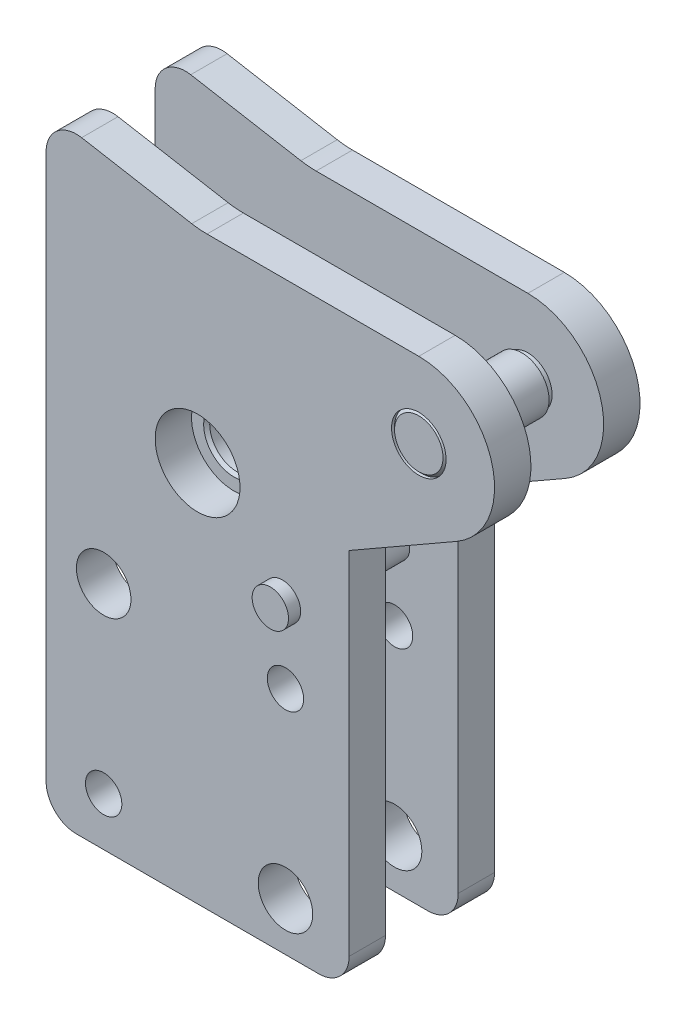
ISO-10303-21;
HEADER;
FILE_DESCRIPTION(('STEP AP214'),'2;1');
FILE_NAME('part.step','',(''),(''),'','','');
FILE_SCHEMA(('AUTOMOTIVE_DESIGN { 1 0 10303 214 1 1 1 1 }'));
ENDSEC;
DATA;
#1=APPLICATION_CONTEXT('core data for automotive mechanical design processes');
#2=APPLICATION_PROTOCOL_DEFINITION('international standard','automotive_design',2000,#1);
#3=PRODUCT_CONTEXT('',#1,'mechanical');
#4=PRODUCT('Part','Part','',(#3));
#5=PRODUCT_RELATED_PRODUCT_CATEGORY('part','',(#4));
#6=PRODUCT_DEFINITION_FORMATION('','',#4);
#7=PRODUCT_DEFINITION_CONTEXT('part definition',#1,'design');
#8=PRODUCT_DEFINITION('design','',#6,#7);
#9=PRODUCT_DEFINITION_SHAPE('','',#8);
#10=(LENGTH_UNIT() NAMED_UNIT(*) SI_UNIT(.MILLI.,.METRE.));
#11=(NAMED_UNIT(*) PLANE_ANGLE_UNIT() SI_UNIT($,.RADIAN.));
#12=(NAMED_UNIT(*) SI_UNIT($,.STERADIAN.) SOLID_ANGLE_UNIT());
#13=UNCERTAINTY_MEASURE_WITH_UNIT(LENGTH_MEASURE(1.E-05),#10,'distance_accuracy_value','');
#14=(GEOMETRIC_REPRESENTATION_CONTEXT(3) GLOBAL_UNCERTAINTY_ASSIGNED_CONTEXT((#13)) GLOBAL_UNIT_ASSIGNED_CONTEXT((#10,
#11,#12)) REPRESENTATION_CONTEXT('',''));
#15=CARTESIAN_POINT('',(0.,0.,0.));
#16=DIRECTION('',(0.,0.,1.));
#17=DIRECTION('',(1.,0.,0.));
#18=AXIS2_PLACEMENT_3D('',#15,#16,#17);
#19=CARTESIAN_POINT('',(61.5,84.,0.));
#20=DIRECTION('',(0.,0.,1.));
#21=DIRECTION('',(1.,0.,0.));
#22=AXIS2_PLACEMENT_3D('',#19,#20,#21);
#23=PLANE('',#22);
#24=CARTESIAN_POINT('',(61.5,84.,0.));
#25=DIRECTION('',(0.,0.,-1.));
#26=DIRECTION('',(-1.,0.,0.));
#27=AXIS2_PLACEMENT_3D('',#24,#25,#26);
#28=CIRCLE('',#27,3.99999999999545);
#29=CARTESIAN_POINT('',(57.5000000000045,84.,0.));
#30=VERTEX_POINT('',#29);
#31=EDGE_CURVE('E17',#30,#30,#28,.T.);
#32=ORIENTED_EDGE('',*,*,#31,.F.);
#33=EDGE_LOOP('',(#32));
#34=FACE_BOUND('',#33,.T.);
#35=ADVANCED_FACE('F14',(#34),#23,.T.);
#36=CARTESIAN_POINT('',(61.5,84.,-0.499999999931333));
#37=DIRECTION('',(0.,0.,-1.));
#38=DIRECTION('',(-1.,0.,0.));
#39=AXIS2_PLACEMENT_3D('',#36,#37,#38);
#40=CONICAL_SURFACE('',#39,4.49999999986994,0.785398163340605);
#41=CARTESIAN_POINT('',(61.5,84.,-0.500000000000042));
#42=DIRECTION('',(0.,0.,-1.));
#43=DIRECTION('',(0.,1.,0.));
#44=AXIS2_PLACEMENT_3D('',#41,#42,#43);
#45=CIRCLE('',#44,4.5);
#46=CARTESIAN_POINT('',(61.5,88.5,-0.50000000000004));
#47=VERTEX_POINT('',#46);
#48=EDGE_CURVE('E239',#47,#47,#45,.F.);
#49=ORIENTED_EDGE('',*,*,#48,.T.);
#50=EDGE_LOOP('',(#49));
#51=FACE_BOUND('',#50,.T.);
#52=ORIENTED_EDGE('',*,*,#31,.T.);
#53=EDGE_LOOP('',(#52));
#54=FACE_BOUND('',#53,.T.);
#55=ADVANCED_FACE('F426',(#51,#54),#40,.T.);
#56=CARTESIAN_POINT('',(39.,50.291,2.));
#57=DIRECTION('',(0.,0.,-1.));
#58=DIRECTION('',(-1.,0.,0.));
#59=AXIS2_PLACEMENT_3D('',#56,#57,#58);
#60=PLANE('',#59);
#61=CARTESIAN_POINT('',(39.,50.291,2.));
#62=DIRECTION('',(0.,0.,1.));
#63=DIRECTION('',(0.,-1.,0.));
#64=AXIS2_PLACEMENT_3D('',#61,#62,#63);
#65=CIRCLE('',#64,3.);
#66=CARTESIAN_POINT('',(39.,47.291,2.));
#67=VERTEX_POINT('',#66);
#68=EDGE_CURVE('E241',#67,#67,#65,.F.);
#69=ORIENTED_EDGE('',*,*,#68,.F.);
#70=EDGE_LOOP('',(#69));
#71=FACE_BOUND('',#70,.T.);
#72=ADVANCED_FACE('F423',(#71),#60,.F.);
#73=CARTESIAN_POINT('',(61.5,84.,0.));
#74=DIRECTION('',(0.,0.,-1.));
#75=DIRECTION('',(0.,1.,0.));
#76=AXIS2_PLACEMENT_3D('',#73,#74,#75);
#77=CYLINDRICAL_SURFACE('',#76,4.5);
#78=CARTESIAN_POINT('',(61.5,84.,0.));
#79=DIRECTION('',(0.,0.,-1.));
#80=DIRECTION('',(0.,1.,0.));
#81=AXIS2_PLACEMENT_3D('',#78,#79,#80);
#82=CIRCLE('',#81,4.5);
#83=CARTESIAN_POINT('',(61.5,88.5,0.));
#84=VERTEX_POINT('',#83);
#85=EDGE_CURVE('E413',#84,#84,#82,.F.);
#86=ORIENTED_EDGE('',*,*,#85,.T.);
#87=EDGE_LOOP('',(#86));
#88=FACE_BOUND('',#87,.T.);
#89=ORIENTED_EDGE('',*,*,#48,.F.);
#90=EDGE_LOOP('',(#89));
#91=FACE_BOUND('',#90,.T.);
#92=ADVANCED_FACE('F425',(#88,#91),#77,.F.);
#93=CARTESIAN_POINT('',(25.,63.,0.));
#94=DIRECTION('',(0.,0.,1.));
#95=DIRECTION('',(1.,0.,0.));
#96=AXIS2_PLACEMENT_3D('',#93,#94,#95);
#97=CYLINDRICAL_SURFACE('',#96,7.);
#98=CARTESIAN_POINT('',(25.,63.,0.));
#99=DIRECTION('',(0.,0.,1.));
#100=DIRECTION('',(1.,0.,0.));
#101=AXIS2_PLACEMENT_3D('',#98,#99,#100);
#102=CIRCLE('',#101,7.);
#103=CARTESIAN_POINT('',(32.,63.,0.));
#104=VERTEX_POINT('',#103);
#105=EDGE_CURVE('E410',#104,#104,#102,.T.);
#106=ORIENTED_EDGE('',*,*,#105,.T.);
#107=EDGE_LOOP('',(#106));
#108=FACE_BOUND('',#107,.T.);
#109=CARTESIAN_POINT('',(25.,63.,-6.));
#110=DIRECTION('',(0.,0.,1.));
#111=DIRECTION('',(1.,0.,0.));
#112=AXIS2_PLACEMENT_3D('',#109,#110,#111);
#113=CIRCLE('',#112,7.);
#114=CARTESIAN_POINT('',(32.,63.,-6.));
#115=VERTEX_POINT('',#114);
#116=EDGE_CURVE('E416',#115,#115,#113,.T.);
#117=ORIENTED_EDGE('',*,*,#116,.F.);
#118=EDGE_LOOP('',(#117));
#119=FACE_BOUND('',#118,.T.);
#120=ADVANCED_FACE('F434',(#108,#119),#97,.F.);
#121=CARTESIAN_POINT('',(39.,50.291,2.));
#122=DIRECTION('',(0.,0.,1.));
#123=DIRECTION('',(0.,-1.,0.));
#124=AXIS2_PLACEMENT_3D('',#121,#122,#123);
#125=CYLINDRICAL_SURFACE('',#124,3.);
#126=CARTESIAN_POINT('',(39.,50.291,0.));
#127=DIRECTION('',(0.,0.,1.));
#128=DIRECTION('',(0.,-1.,0.));
#129=AXIS2_PLACEMENT_3D('',#126,#127,#128);
#130=CIRCLE('',#129,3.);
#131=CARTESIAN_POINT('',(39.,47.291,0.));
#132=VERTEX_POINT('',#131);
#133=EDGE_CURVE('E407',#132,#132,#130,.T.);
#134=ORIENTED_EDGE('',*,*,#133,.T.);
#135=EDGE_LOOP('',(#134));
#136=FACE_BOUND('',#135,.T.);
#137=ORIENTED_EDGE('',*,*,#68,.T.);
#138=EDGE_LOOP('',(#137));
#139=FACE_BOUND('',#138,.T.);
#140=ADVANCED_FACE('F421',(#136,#139),#125,.T.);
#141=CARTESIAN_POINT('',(25.,63.,-5.99999999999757));
#142=DIRECTION('',(0.,0.,1.));
#143=DIRECTION('',(1.,0.,0.));
#144=AXIS2_PLACEMENT_3D('',#141,#142,#143);
#145=PLANE('',#144);
#146=ORIENTED_EDGE('',*,*,#116,.T.);
#147=EDGE_LOOP('',(#146));
#148=FACE_BOUND('',#147,.T.);
#149=CARTESIAN_POINT('',(25.,63.,-6.00000000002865));
#150=DIRECTION('',(0.,0.,1.));
#151=DIRECTION('',(0.,-1.,0.));
#152=AXIS2_PLACEMENT_3D('',#149,#150,#151);
#153=CIRCLE('',#152,5.00000000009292);
#154=CARTESIAN_POINT('',(25.,57.9999999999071,-6.00000000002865));
#155=VERTEX_POINT('',#154);
#156=EDGE_CURVE('E404',#155,#155,#153,.F.);
#157=ORIENTED_EDGE('',*,*,#156,.T.);
#158=EDGE_LOOP('',(#157));
#159=FACE_BOUND('',#158,.T.);
#160=ADVANCED_FACE('F649',(#148,#159),#145,.T.);
#161=CARTESIAN_POINT('',(68.5,84.,-7.));
#162=DIRECTION('',(0.,0.,-1.));
#163=DIRECTION('',(-1.,0.,0.));
#164=AXIS2_PLACEMENT_3D('',#161,#162,#163);
#165=PLANE('',#164);
#166=CARTESIAN_POINT('',(61.5,84.,-7.));
#167=DIRECTION('',(0.,0.,-1.));
#168=DIRECTION('',(-1.,0.,0.));
#169=AXIS2_PLACEMENT_3D('',#166,#167,#168);
#170=CIRCLE('',#169,4.5);
#171=CARTESIAN_POINT('',(57.,84.,-7.));
#172=VERTEX_POINT('',#171);
#173=EDGE_CURVE('E401',#172,#172,#170,.T.);
#174=ORIENTED_EDGE('',*,*,#173,.F.);
#175=EDGE_LOOP('',(#174));
#176=FACE_BOUND('',#175,.T.);
#177=CARTESIAN_POINT('',(61.5,84.,-7.));
#178=DIRECTION('',(0.,0.,1.));
#179=DIRECTION('',(1.,0.,0.));
#180=AXIS2_PLACEMENT_3D('',#177,#178,#179);
#181=CIRCLE('',#180,4.);
#182=CARTESIAN_POINT('',(65.5,84.,-7.));
#183=VERTEX_POINT('',#182);
#184=EDGE_CURVE('E398',#183,#183,#181,.T.);
#185=ORIENTED_EDGE('',*,*,#184,.F.);
#186=EDGE_LOOP('',(#185));
#187=FACE_BOUND('',#186,.T.);
#188=ADVANCED_FACE('F645',(#176,#187),#165,.F.);
#189=CARTESIAN_POINT('',(61.5,84.,0.));
#190=DIRECTION('',(0.,0.,-1.));
#191=DIRECTION('',(0.,1.,0.));
#192=AXIS2_PLACEMENT_3D('',#189,#190,#191);
#193=PLANE('',#192);
#194=ORIENTED_EDGE('',*,*,#133,.F.);
#195=EDGE_LOOP('',(#194));
#196=FACE_BOUND('',#195,.T.);
#197=CARTESIAN_POINT('',(39.5,38.,0.));
#198=DIRECTION('',(0.,0.,1.));
#199=DIRECTION('',(1.,0.,0.));
#200=AXIS2_PLACEMENT_3D('',#197,#198,#199);
#201=CIRCLE('',#200,3.);
#202=CARTESIAN_POINT('',(42.5,38.,0.));
#203=VERTEX_POINT('',#202);
#204=EDGE_CURVE('E395',#203,#203,#201,.F.);
#205=ORIENTED_EDGE('',*,*,#204,.T.);
#206=EDGE_LOOP('',(#205));
#207=FACE_BOUND('',#206,.T.);
#208=CARTESIAN_POINT('',(9.5,8.,0.));
#209=DIRECTION('',(0.,0.,1.));
#210=DIRECTION('',(1.,0.,0.));
#211=AXIS2_PLACEMENT_3D('',#208,#209,#210);
#212=CIRCLE('',#211,3.);
#213=CARTESIAN_POINT('',(12.5,8.,0.));
#214=VERTEX_POINT('',#213);
#215=EDGE_CURVE('E392',#214,#214,#212,.F.);
#216=ORIENTED_EDGE('',*,*,#215,.T.);
#217=EDGE_LOOP('',(#216));
#218=FACE_BOUND('',#217,.T.);
#219=CARTESIAN_POINT('',(39.5,8.,0.));
#220=DIRECTION('',(0.,0.,1.));
#221=DIRECTION('',(1.,0.,0.));
#222=AXIS2_PLACEMENT_3D('',#219,#220,#221);
#223=CIRCLE('',#222,4.5);
#224=CARTESIAN_POINT('',(44.,8.,0.));
#225=VERTEX_POINT('',#224);
#226=EDGE_CURVE('E389',#225,#225,#223,.F.);
#227=ORIENTED_EDGE('',*,*,#226,.T.);
#228=EDGE_LOOP('',(#227));
#229=FACE_BOUND('',#228,.T.);
#230=CARTESIAN_POINT('',(9.5,38.,0.));
#231=DIRECTION('',(0.,0.,1.));
#232=DIRECTION('',(1.,0.,0.));
#233=AXIS2_PLACEMENT_3D('',#230,#231,#232);
#234=CIRCLE('',#233,4.5);
#235=CARTESIAN_POINT('',(14.,38.,0.));
#236=VERTEX_POINT('',#235);
#237=EDGE_CURVE('E176',#236,#236,#234,.F.);
#238=ORIENTED_EDGE('',*,*,#237,.T.);
#239=EDGE_LOOP('',(#238));
#240=FACE_BOUND('',#239,.T.);
#241=ORIENTED_EDGE('',*,*,#105,.F.);
#242=EDGE_LOOP('',(#241));
#243=FACE_BOUND('',#242,.T.);
#244=DIRECTION('',(1.,0.,0.));
#245=VECTOR('',#244,1.);
#246=CARTESIAN_POINT('',(61.5,96.5,0.));
#247=LINE('',#246,#245);
#248=CARTESIAN_POINT('',(61.5,96.5,0.));
#249=VERTEX_POINT('',#248);
#250=CARTESIAN_POINT('',(26.555515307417,96.5,0.));
#251=VERTEX_POINT('',#250);
#252=EDGE_CURVE('E155',#249,#251,#247,.F.);
#253=ORIENTED_EDGE('',*,*,#252,.T.);
#254=CARTESIAN_POINT('',(26.555515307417,111.,0.));
#255=DIRECTION('',(0.,0.,-1.));
#256=DIRECTION('',(-1.,0.,0.));
#257=AXIS2_PLACEMENT_3D('',#254,#255,#256);
#258=CIRCLE('',#257,14.4999999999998);
#259=CARTESIAN_POINT('',(24.0376167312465,96.720287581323,0.));
#260=VERTEX_POINT('',#259);
#261=EDGE_CURVE('E159',#251,#260,#258,.T.);
#262=ORIENTED_EDGE('',*,*,#261,.T.);
#263=DIRECTION('',(0.984807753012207,-0.173648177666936,0.));
#264=VECTOR('',#263,1.);
#265=CARTESIAN_POINT('',(24.0376167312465,96.720287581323,0.));
#266=LINE('',#265,#264);
#267=CARTESIAN_POINT('',(5.86824088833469,99.924038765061,0.));
#268=VERTEX_POINT('',#267);
#269=EDGE_CURVE('E224',#260,#268,#266,.F.);
#270=ORIENTED_EDGE('',*,*,#269,.T.);
#271=CARTESIAN_POINT('',(5.,95.,0.));
#272=DIRECTION('',(0.,0.,-1.));
#273=DIRECTION('',(-1.,0.,0.));
#274=AXIS2_PLACEMENT_3D('',#271,#272,#273);
#275=CIRCLE('',#274,5.);
#276=CARTESIAN_POINT('',(0.,95.,0.));
#277=VERTEX_POINT('',#276);
#278=EDGE_CURVE('E222',#277,#268,#275,.T.);
#279=ORIENTED_EDGE('',*,*,#278,.F.);
#280=DIRECTION('',(0.,1.,0.));
#281=VECTOR('',#280,1.);
#282=CARTESIAN_POINT('',(0.,95.,0.));
#283=LINE('',#282,#281);
#284=CARTESIAN_POINT('',(0.,5.,0.));
#285=VERTEX_POINT('',#284);
#286=EDGE_CURVE('E218',#277,#285,#283,.F.);
#287=ORIENTED_EDGE('',*,*,#286,.T.);
#288=CARTESIAN_POINT('',(5.,5.,0.));
#289=DIRECTION('',(0.,0.,-1.));
#290=DIRECTION('',(-1.,0.,0.));
#291=AXIS2_PLACEMENT_3D('',#288,#289,#290);
#292=CIRCLE('',#291,5.);
#293=CARTESIAN_POINT('',(5.,0.,0.));
#294=VERTEX_POINT('',#293);
#295=EDGE_CURVE('E214',#294,#285,#292,.T.);
#296=ORIENTED_EDGE('',*,*,#295,.F.);
#297=DIRECTION('',(1.,0.,0.));
#298=VECTOR('',#297,1.);
#299=CARTESIAN_POINT('',(5.,0.,0.));
#300=LINE('',#299,#298);
#301=CARTESIAN_POINT('',(45.,0.,0.));
#302=VERTEX_POINT('',#301);
#303=EDGE_CURVE('E210',#294,#302,#300,.T.);
#304=ORIENTED_EDGE('',*,*,#303,.T.);
#305=CARTESIAN_POINT('',(45.,5.,0.));
#306=DIRECTION('',(0.,0.,-1.));
#307=DIRECTION('',(-1.,0.,0.));
#308=AXIS2_PLACEMENT_3D('',#305,#306,#307);
#309=CIRCLE('',#308,5.);
#310=CARTESIAN_POINT('',(50.,5.,0.));
#311=VERTEX_POINT('',#310);
#312=EDGE_CURVE('E206',#311,#302,#309,.T.);
#313=ORIENTED_EDGE('',*,*,#312,.F.);
#314=DIRECTION('',(0.,1.,0.));
#315=VECTOR('',#314,1.);
#316=CARTESIAN_POINT('',(50.,5.,0.));
#317=LINE('',#316,#315);
#318=CARTESIAN_POINT('',(50.,63.,0.));
#319=VERTEX_POINT('',#318);
#320=EDGE_CURVE('E197',#311,#319,#317,.T.);
#321=ORIENTED_EDGE('',*,*,#320,.T.);
#322=DIRECTION('',(-0.86757373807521,-0.497308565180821,0.));
#323=VECTOR('',#322,1.);
#324=CARTESIAN_POINT('',(50.,63.,0.));
#325=LINE('',#324,#323);
#326=CARTESIAN_POINT('',(67.7163570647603,73.1553282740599,0.));
#327=VERTEX_POINT('',#326);
#328=EDGE_CURVE('E196',#319,#327,#325,.F.);
#329=ORIENTED_EDGE('',*,*,#328,.T.);
#330=CARTESIAN_POINT('',(61.5,84.,0.));
#331=DIRECTION('',(0.,0.,-1.));
#332=DIRECTION('',(-1.,0.,0.));
#333=AXIS2_PLACEMENT_3D('',#330,#331,#332);
#334=CIRCLE('',#333,12.5);
#335=EDGE_CURVE('E162',#249,#327,#334,.T.);
#336=ORIENTED_EDGE('',*,*,#335,.F.);
#337=EDGE_LOOP('',(#253,#262,#270,#279,#287,#296,#304,#313,#321,#329,#336));
#338=FACE_BOUND('',#337,.T.);
#339=ORIENTED_EDGE('',*,*,#85,.F.);
#340=EDGE_LOOP('',(#339));
#341=FACE_BOUND('',#340,.T.);
#342=ADVANCED_FACE('F157',(#196,#207,#218,#229,#240,#243,#338,#341),#193,.F.);
#343=CARTESIAN_POINT('',(25.,63.,-6.00000000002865));
#344=DIRECTION('',(0.,0.,1.));
#345=DIRECTION('',(0.,-1.,0.));
#346=AXIS2_PLACEMENT_3D('',#343,#344,#345);
#347=CONICAL_SURFACE('',#346,5.00000000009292,0.785398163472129);
#348=CARTESIAN_POINT('',(25.,63.,-6.49999999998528));
#349=DIRECTION('',(0.,0.,-1.));
#350=DIRECTION('',(0.,1.,0.));
#351=AXIS2_PLACEMENT_3D('',#348,#349,#350);
#352=CIRCLE('',#351,4.5);
#353=CARTESIAN_POINT('',(25.,67.5,-6.49999999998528));
#354=VERTEX_POINT('',#353);
#355=EDGE_CURVE('E182',#354,#354,#352,.T.);
#356=ORIENTED_EDGE('',*,*,#355,.T.);
#357=EDGE_LOOP('',(#356));
#358=FACE_BOUND('',#357,.T.);
#359=ORIENTED_EDGE('',*,*,#156,.F.);
#360=EDGE_LOOP('',(#359));
#361=FACE_BOUND('',#360,.T.);
#362=ADVANCED_FACE('F638',(#358,#361),#347,.F.);
#363=CARTESIAN_POINT('',(61.5,84.,-6.5));
#364=DIRECTION('',(0.,0.,-1.));
#365=DIRECTION('',(-1.,0.,0.));
#366=AXIS2_PLACEMENT_3D('',#363,#364,#365);
#367=CYLINDRICAL_SURFACE('',#366,4.5);
#368=CARTESIAN_POINT('',(61.5,84.,-17.));
#369=DIRECTION('',(0.,0.,-1.));
#370=DIRECTION('',(-1.,0.,0.));
#371=AXIS2_PLACEMENT_3D('',#368,#369,#370);
#372=CIRCLE('',#371,4.5);
#373=CARTESIAN_POINT('',(57.,84.,-17.));
#374=VERTEX_POINT('',#373);
#375=EDGE_CURVE('E185',#374,#374,#372,.F.);
#376=ORIENTED_EDGE('',*,*,#375,.T.);
#377=EDGE_LOOP('',(#376));
#378=FACE_BOUND('',#377,.T.);
#379=ORIENTED_EDGE('',*,*,#173,.T.);
#380=EDGE_LOOP('',(#379));
#381=FACE_BOUND('',#380,.T.);
#382=ADVANCED_FACE('F634',(#378,#381),#367,.T.);
#383=CARTESIAN_POINT('',(61.5,84.,-18.));
#384=DIRECTION('',(0.,0.,1.));
#385=DIRECTION('',(1.,0.,0.));
#386=AXIS2_PLACEMENT_3D('',#383,#384,#385);
#387=CYLINDRICAL_SURFACE('',#386,4.);
#388=ORIENTED_EDGE('',*,*,#184,.T.);
#389=EDGE_LOOP('',(#388));
#390=FACE_BOUND('',#389,.T.);
#391=CARTESIAN_POINT('',(61.5,84.,-6.));
#392=DIRECTION('',(0.,0.,1.));
#393=DIRECTION('',(1.,0.,0.));
#394=AXIS2_PLACEMENT_3D('',#391,#392,#393);
#395=CIRCLE('',#394,4.);
#396=CARTESIAN_POINT('',(65.5,84.,-6.));
#397=VERTEX_POINT('',#396);
#398=EDGE_CURVE('E227',#397,#397,#395,.F.);
#399=ORIENTED_EDGE('',*,*,#398,.T.);
#400=EDGE_LOOP('',(#399));
#401=FACE_BOUND('',#400,.T.);
#402=ADVANCED_FACE('F630',(#390,#401),#387,.T.);
#403=CARTESIAN_POINT('',(25.,63.,-6.49999999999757));
#404=DIRECTION('',(0.,0.,-1.));
#405=DIRECTION('',(0.,1.,0.));
#406=AXIS2_PLACEMENT_3D('',#403,#404,#405);
#407=CONICAL_SURFACE('',#406,11.,0.78539816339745);
#408=CARTESIAN_POINT('',(25.,63.,-6.49999999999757));
#409=DIRECTION('',(0.,0.,-1.));
#410=DIRECTION('',(0.,1.,0.));
#411=AXIS2_PLACEMENT_3D('',#408,#409,#410);
#412=CIRCLE('',#411,11.);
#413=CARTESIAN_POINT('',(25.,74.,-6.49999999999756));
#414=VERTEX_POINT('',#413);
#415=EDGE_CURVE('E225',#414,#414,#412,.T.);
#416=ORIENTED_EDGE('',*,*,#415,.F.);
#417=EDGE_LOOP('',(#416));
#418=FACE_BOUND('',#417,.T.);
#419=CARTESIAN_POINT('',(25.,63.,-5.99999999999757));
#420=DIRECTION('',(0.,0.,-1.));
#421=DIRECTION('',(0.,1.,0.));
#422=AXIS2_PLACEMENT_3D('',#419,#420,#421);
#423=CIRCLE('',#422,10.5);
#424=CARTESIAN_POINT('',(25.,73.5,-5.99999999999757));
#425=VERTEX_POINT('',#424);
#426=EDGE_CURVE('E373',#425,#425,#423,.T.);
#427=ORIENTED_EDGE('',*,*,#426,.T.);
#428=EDGE_LOOP('',(#427));
#429=FACE_BOUND('',#428,.T.);
#430=ADVANCED_FACE('F626',(#418,#429),#407,.T.);
#431=CARTESIAN_POINT('',(39.5,38.,0.));
#432=DIRECTION('',(0.,0.,1.));
#433=DIRECTION('',(1.,0.,0.));
#434=AXIS2_PLACEMENT_3D('',#431,#432,#433);
#435=CYLINDRICAL_SURFACE('',#434,3.);
#436=ORIENTED_EDGE('',*,*,#204,.F.);
#437=EDGE_LOOP('',(#436));
#438=FACE_BOUND('',#437,.T.);
#439=CARTESIAN_POINT('',(39.5,38.,-6.));
#440=DIRECTION('',(0.,0.,1.));
#441=DIRECTION('',(1.,0.,0.));
#442=AXIS2_PLACEMENT_3D('',#439,#440,#441);
#443=CIRCLE('',#442,3.);
#444=CARTESIAN_POINT('',(42.5,38.,-6.));
#445=VERTEX_POINT('',#444);
#446=EDGE_CURVE('E370',#445,#445,#443,.F.);
#447=ORIENTED_EDGE('',*,*,#446,.T.);
#448=EDGE_LOOP('',(#447));
#449=FACE_BOUND('',#448,.T.);
#450=ADVANCED_FACE('F622',(#438,#449),#435,.F.);
#451=CARTESIAN_POINT('',(9.5,8.,0.));
#452=DIRECTION('',(0.,0.,1.));
#453=DIRECTION('',(1.,0.,0.));
#454=AXIS2_PLACEMENT_3D('',#451,#452,#453);
#455=CYLINDRICAL_SURFACE('',#454,3.);
#456=ORIENTED_EDGE('',*,*,#215,.F.);
#457=EDGE_LOOP('',(#456));
#458=FACE_BOUND('',#457,.T.);
#459=CARTESIAN_POINT('',(9.5,8.,-6.));
#460=DIRECTION('',(0.,0.,1.));
#461=DIRECTION('',(1.,0.,0.));
#462=AXIS2_PLACEMENT_3D('',#459,#460,#461);
#463=CIRCLE('',#462,3.);
#464=CARTESIAN_POINT('',(12.5,8.,-6.));
#465=VERTEX_POINT('',#464);
#466=EDGE_CURVE('E367',#465,#465,#463,.F.);
#467=ORIENTED_EDGE('',*,*,#466,.T.);
#468=EDGE_LOOP('',(#467));
#469=FACE_BOUND('',#468,.T.);
#470=ADVANCED_FACE('F618',(#458,#469),#455,.F.);
#471=CARTESIAN_POINT('',(39.5,8.,0.));
#472=DIRECTION('',(0.,0.,1.));
#473=DIRECTION('',(1.,0.,0.));
#474=AXIS2_PLACEMENT_3D('',#471,#472,#473);
#475=CYLINDRICAL_SURFACE('',#474,4.5);
#476=ORIENTED_EDGE('',*,*,#226,.F.);
#477=EDGE_LOOP('',(#476));
#478=FACE_BOUND('',#477,.T.);
#479=CARTESIAN_POINT('',(39.5,8.,-6.));
#480=DIRECTION('',(0.,0.,1.));
#481=DIRECTION('',(1.,0.,0.));
#482=AXIS2_PLACEMENT_3D('',#479,#480,#481);
#483=CIRCLE('',#482,4.5);
#484=CARTESIAN_POINT('',(44.,8.,-6.));
#485=VERTEX_POINT('',#484);
#486=EDGE_CURVE('E364',#485,#485,#483,.F.);
#487=ORIENTED_EDGE('',*,*,#486,.T.);
#488=EDGE_LOOP('',(#487));
#489=FACE_BOUND('',#488,.T.);
#490=ADVANCED_FACE('F614',(#478,#489),#475,.F.);
#491=CARTESIAN_POINT('',(9.5,38.,0.));
#492=DIRECTION('',(0.,0.,1.));
#493=DIRECTION('',(1.,0.,0.));
#494=AXIS2_PLACEMENT_3D('',#491,#492,#493);
#495=CYLINDRICAL_SURFACE('',#494,4.5);
#496=ORIENTED_EDGE('',*,*,#237,.F.);
#497=EDGE_LOOP('',(#496));
#498=FACE_BOUND('',#497,.T.);
#499=CARTESIAN_POINT('',(9.5,38.,-6.));
#500=DIRECTION('',(0.,0.,1.));
#501=DIRECTION('',(1.,0.,0.));
#502=AXIS2_PLACEMENT_3D('',#499,#500,#501);
#503=CIRCLE('',#502,4.5);
#504=CARTESIAN_POINT('',(14.,38.,-6.));
#505=VERTEX_POINT('',#504);
#506=EDGE_CURVE('E361',#505,#505,#503,.F.);
#507=ORIENTED_EDGE('',*,*,#506,.T.);
#508=EDGE_LOOP('',(#507));
#509=FACE_BOUND('',#508,.T.);
#510=ADVANCED_FACE('F611',(#498,#509),#495,.F.);
#511=CARTESIAN_POINT('',(26.555515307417,111.,0.));
#512=DIRECTION('',(0.,0.,-1.));
#513=DIRECTION('',(-1.,0.,0.));
#514=AXIS2_PLACEMENT_3D('',#511,#512,#513);
#515=CYLINDRICAL_SURFACE('',#514,14.4999999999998);
#516=ORIENTED_EDGE('',*,*,#261,.F.);
#517=DIRECTION('',(0.,0.,-1.));
#518=VECTOR('',#517,1.);
#519=CARTESIAN_POINT('',(26.555515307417,96.5,0.));
#520=LINE('',#519,#518);
#521=CARTESIAN_POINT('',(26.555515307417,96.5,-6.));
#522=VERTEX_POINT('',#521);
#523=EDGE_CURVE('E167',#251,#522,#520,.T.);
#524=ORIENTED_EDGE('',*,*,#523,.T.);
#525=CARTESIAN_POINT('',(26.555515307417,111.,-6.));
#526=DIRECTION('',(0.,0.,-1.));
#527=DIRECTION('',(-1.,0.,0.));
#528=AXIS2_PLACEMENT_3D('',#525,#526,#527);
#529=CIRCLE('',#528,14.4999999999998);
#530=CARTESIAN_POINT('',(24.0376167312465,96.720287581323,-6.));
#531=VERTEX_POINT('',#530);
#532=EDGE_CURVE('E359',#522,#531,#529,.T.);
#533=ORIENTED_EDGE('',*,*,#532,.T.);
#534=DIRECTION('',(0.,0.,1.));
#535=VECTOR('',#534,1.);
#536=CARTESIAN_POINT('',(24.0376167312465,96.720287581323,0.));
#537=LINE('',#536,#535);
#538=EDGE_CURVE('E174',#531,#260,#537,.T.);
#539=ORIENTED_EDGE('',*,*,#538,.T.);
#540=EDGE_LOOP('',(#516,#524,#533,#539));
#541=FACE_BOUND('',#540,.T.);
#542=ADVANCED_FACE('F171',(#541),#515,.F.);
#543=CARTESIAN_POINT('',(24.0376167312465,96.720287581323,0.));
#544=DIRECTION('',(-0.173648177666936,-0.984807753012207,0.));
#545=DIRECTION('',(0.984807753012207,-0.173648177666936,0.));
#546=AXIS2_PLACEMENT_3D('',#543,#544,#545);
#547=PLANE('',#546);
#548=ORIENTED_EDGE('',*,*,#269,.F.);
#549=ORIENTED_EDGE('',*,*,#538,.F.);
#550=DIRECTION('',(-0.984807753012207,0.173648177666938,0.));
#551=VECTOR('',#550,1.);
#552=CARTESIAN_POINT('',(24.0376167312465,96.720287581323,-6.));
#553=LINE('',#552,#551);
#554=CARTESIAN_POINT('',(5.86824088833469,99.9240387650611,-6.));
#555=VERTEX_POINT('',#554);
#556=EDGE_CURVE('E358',#531,#555,#553,.T.);
#557=ORIENTED_EDGE('',*,*,#556,.T.);
#558=DIRECTION('',(0.,0.,-1.));
#559=VECTOR('',#558,1.);
#560=CARTESIAN_POINT('',(5.86824088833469,99.924038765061,0.));
#561=LINE('',#560,#559);
#562=EDGE_CURVE('E219',#268,#555,#561,.T.);
#563=ORIENTED_EDGE('',*,*,#562,.F.);
#564=EDGE_LOOP('',(#548,#549,#557,#563));
#565=FACE_BOUND('',#564,.T.);
#566=ADVANCED_FACE('F604',(#565),#547,.F.);
#567=CARTESIAN_POINT('',(5.,95.,0.));
#568=DIRECTION('',(0.,0.,-1.));
#569=DIRECTION('',(-1.,0.,0.));
#570=AXIS2_PLACEMENT_3D('',#567,#568,#569);
#571=CYLINDRICAL_SURFACE('',#570,5.);
#572=CARTESIAN_POINT('',(5.,95.,-6.));
#573=DIRECTION('',(0.,0.,-1.));
#574=DIRECTION('',(-1.,0.,0.));
#575=AXIS2_PLACEMENT_3D('',#572,#573,#574);
#576=CIRCLE('',#575,5.);
#577=CARTESIAN_POINT('',(0.,95.,-6.));
#578=VERTEX_POINT('',#577);
#579=EDGE_CURVE('E356',#555,#578,#576,.F.);
#580=ORIENTED_EDGE('',*,*,#579,.T.);
#581=DIRECTION('',(0.,0.,1.));
#582=VECTOR('',#581,1.);
#583=CARTESIAN_POINT('',(0.,95.,0.));
#584=LINE('',#583,#582);
#585=EDGE_CURVE('E215',#578,#277,#584,.T.);
#586=ORIENTED_EDGE('',*,*,#585,.T.);
#587=ORIENTED_EDGE('',*,*,#278,.T.);
#588=ORIENTED_EDGE('',*,*,#562,.T.);
#589=EDGE_LOOP('',(#580,#586,#587,#588));
#590=FACE_BOUND('',#589,.T.);
#591=ADVANCED_FACE('F600',(#590),#571,.T.);
#592=CARTESIAN_POINT('',(0.,95.,0.));
#593=DIRECTION('',(1.,0.,0.));
#594=DIRECTION('',(0.,1.,0.));
#595=AXIS2_PLACEMENT_3D('',#592,#593,#594);
#596=PLANE('',#595);
#597=ORIENTED_EDGE('',*,*,#286,.F.);
#598=ORIENTED_EDGE('',*,*,#585,.F.);
#599=DIRECTION('',(0.,1.,0.));
#600=VECTOR('',#599,1.);
#601=CARTESIAN_POINT('',(0.,84.,-6.));
#602=LINE('',#601,#600);
#603=CARTESIAN_POINT('',(0.,5.,-6.));
#604=VERTEX_POINT('',#603);
#605=EDGE_CURVE('E355',#578,#604,#602,.F.);
#606=ORIENTED_EDGE('',*,*,#605,.T.);
#607=DIRECTION('',(0.,0.,-1.));
#608=VECTOR('',#607,1.);
#609=CARTESIAN_POINT('',(0.,5.,0.));
#610=LINE('',#609,#608);
#611=EDGE_CURVE('E211',#285,#604,#610,.T.);
#612=ORIENTED_EDGE('',*,*,#611,.F.);
#613=EDGE_LOOP('',(#597,#598,#606,#612));
#614=FACE_BOUND('',#613,.T.);
#615=ADVANCED_FACE('F596',(#614),#596,.F.);
#616=CARTESIAN_POINT('',(5.,5.,0.));
#617=DIRECTION('',(0.,0.,-1.));
#618=DIRECTION('',(-1.,0.,0.));
#619=AXIS2_PLACEMENT_3D('',#616,#617,#618);
#620=CYLINDRICAL_SURFACE('',#619,5.);
#621=CARTESIAN_POINT('',(5.,5.,-6.));
#622=DIRECTION('',(0.,0.,-1.));
#623=DIRECTION('',(-1.,0.,0.));
#624=AXIS2_PLACEMENT_3D('',#621,#622,#623);
#625=CIRCLE('',#624,5.);
#626=CARTESIAN_POINT('',(5.,0.,-6.));
#627=VERTEX_POINT('',#626);
#628=EDGE_CURVE('E353',#604,#627,#625,.F.);
#629=ORIENTED_EDGE('',*,*,#628,.T.);
#630=DIRECTION('',(0.,0.,1.));
#631=VECTOR('',#630,1.);
#632=CARTESIAN_POINT('',(5.,0.,0.));
#633=LINE('',#632,#631);
#634=EDGE_CURVE('E207',#627,#294,#633,.T.);
#635=ORIENTED_EDGE('',*,*,#634,.T.);
#636=ORIENTED_EDGE('',*,*,#295,.T.);
#637=ORIENTED_EDGE('',*,*,#611,.T.);
#638=EDGE_LOOP('',(#629,#635,#636,#637));
#639=FACE_BOUND('',#638,.T.);
#640=ADVANCED_FACE('F592',(#639),#620,.T.);
#641=CARTESIAN_POINT('',(5.,0.,0.));
#642=DIRECTION('',(0.,1.,0.));
#643=DIRECTION('',(0.,0.,1.));
#644=AXIS2_PLACEMENT_3D('',#641,#642,#643);
#645=PLANE('',#644);
#646=ORIENTED_EDGE('',*,*,#303,.F.);
#647=ORIENTED_EDGE('',*,*,#634,.F.);
#648=DIRECTION('',(1.,0.,0.));
#649=VECTOR('',#648,1.);
#650=CARTESIAN_POINT('',(68.5,0.,-6.));
#651=LINE('',#650,#649);
#652=CARTESIAN_POINT('',(45.,0.,-6.));
#653=VERTEX_POINT('',#652);
#654=EDGE_CURVE('E352',#627,#653,#651,.T.);
#655=ORIENTED_EDGE('',*,*,#654,.T.);
#656=DIRECTION('',(0.,0.,-1.));
#657=VECTOR('',#656,1.);
#658=CARTESIAN_POINT('',(45.,0.,0.));
#659=LINE('',#658,#657);
#660=EDGE_CURVE('E203',#302,#653,#659,.T.);
#661=ORIENTED_EDGE('',*,*,#660,.F.);
#662=EDGE_LOOP('',(#646,#647,#655,#661));
#663=FACE_BOUND('',#662,.T.);
#664=ADVANCED_FACE('F588',(#663),#645,.F.);
#665=CARTESIAN_POINT('',(45.,5.,0.));
#666=DIRECTION('',(0.,0.,-1.));
#667=DIRECTION('',(-1.,0.,0.));
#668=AXIS2_PLACEMENT_3D('',#665,#666,#667);
#669=CYLINDRICAL_SURFACE('',#668,5.);
#670=CARTESIAN_POINT('',(45.,5.,-6.));
#671=DIRECTION('',(0.,0.,-1.));
#672=DIRECTION('',(-1.,0.,0.));
#673=AXIS2_PLACEMENT_3D('',#670,#671,#672);
#674=CIRCLE('',#673,5.);
#675=CARTESIAN_POINT('',(50.,5.,-6.));
#676=VERTEX_POINT('',#675);
#677=EDGE_CURVE('E349',#653,#676,#674,.F.);
#678=ORIENTED_EDGE('',*,*,#677,.T.);
#679=DIRECTION('',(0.,0.,1.));
#680=VECTOR('',#679,1.);
#681=CARTESIAN_POINT('',(50.,5.,0.));
#682=LINE('',#681,#680);
#683=EDGE_CURVE('E200',#676,#311,#682,.T.);
#684=ORIENTED_EDGE('',*,*,#683,.T.);
#685=ORIENTED_EDGE('',*,*,#312,.T.);
#686=ORIENTED_EDGE('',*,*,#660,.T.);
#687=EDGE_LOOP('',(#678,#684,#685,#686));
#688=FACE_BOUND('',#687,.T.);
#689=ADVANCED_FACE('F584',(#688),#669,.T.);
#690=CARTESIAN_POINT('',(50.,5.,0.));
#691=DIRECTION('',(-1.,0.,0.));
#692=DIRECTION('',(0.,0.,1.));
#693=AXIS2_PLACEMENT_3D('',#690,#691,#692);
#694=PLANE('',#693);
#695=ORIENTED_EDGE('',*,*,#320,.F.);
#696=ORIENTED_EDGE('',*,*,#683,.F.);
#697=DIRECTION('',(0.,1.,0.));
#698=VECTOR('',#697,1.);
#699=CARTESIAN_POINT('',(50.,84.,-6.));
#700=LINE('',#699,#698);
#701=CARTESIAN_POINT('',(50.,63.,-6.));
#702=VERTEX_POINT('',#701);
#703=EDGE_CURVE('E351',#676,#702,#700,.T.);
#704=ORIENTED_EDGE('',*,*,#703,.T.);
#705=DIRECTION('',(0.,0.,1.));
#706=VECTOR('',#705,1.);
#707=CARTESIAN_POINT('',(50.,63.,0.));
#708=LINE('',#707,#706);
#709=EDGE_CURVE('E193',#702,#319,#708,.T.);
#710=ORIENTED_EDGE('',*,*,#709,.T.);
#711=EDGE_LOOP('',(#695,#696,#704,#710));
#712=FACE_BOUND('',#711,.T.);
#713=ADVANCED_FACE('F580',(#712),#694,.F.);
#714=CARTESIAN_POINT('',(50.,63.,0.));
#715=DIRECTION('',(-0.497308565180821,0.86757373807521,0.));
#716=DIRECTION('',(-0.86757373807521,-0.497308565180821,0.));
#717=AXIS2_PLACEMENT_3D('',#714,#715,#716);
#718=PLANE('',#717);
#719=ORIENTED_EDGE('',*,*,#328,.F.);
#720=ORIENTED_EDGE('',*,*,#709,.F.);
#721=DIRECTION('',(0.867573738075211,0.49730856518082,0.));
#722=VECTOR('',#721,1.);
#723=CARTESIAN_POINT('',(50.,63.,-6.));
#724=LINE('',#723,#722);
#725=CARTESIAN_POINT('',(67.7163570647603,73.1553282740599,-6.));
#726=VERTEX_POINT('',#725);
#727=EDGE_CURVE('E348',#702,#726,#724,.T.);
#728=ORIENTED_EDGE('',*,*,#727,.T.);
#729=DIRECTION('',(0.,0.,-1.));
#730=VECTOR('',#729,1.);
#731=CARTESIAN_POINT('',(67.7163570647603,73.1553282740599,0.));
#732=LINE('',#731,#730);
#733=EDGE_CURVE('E190',#327,#726,#732,.T.);
#734=ORIENTED_EDGE('',*,*,#733,.F.);
#735=EDGE_LOOP('',(#719,#720,#728,#734));
#736=FACE_BOUND('',#735,.T.);
#737=ADVANCED_FACE('F576',(#736),#718,.F.);
#738=CARTESIAN_POINT('',(61.5,84.,0.));
#739=DIRECTION('',(0.,0.,-1.));
#740=DIRECTION('',(-1.,0.,0.));
#741=AXIS2_PLACEMENT_3D('',#738,#739,#740);
#742=CYLINDRICAL_SURFACE('',#741,12.5);
#743=CARTESIAN_POINT('',(61.5,84.,-6.));
#744=DIRECTION('',(0.,0.,-1.));
#745=DIRECTION('',(-1.,0.,0.));
#746=AXIS2_PLACEMENT_3D('',#743,#744,#745);
#747=CIRCLE('',#746,12.5);
#748=CARTESIAN_POINT('',(61.5,96.5,-6.));
#749=VERTEX_POINT('',#748);
#750=EDGE_CURVE('E346',#726,#749,#747,.F.);
#751=ORIENTED_EDGE('',*,*,#750,.T.);
#752=DIRECTION('',(0.,0.,-1.));
#753=VECTOR('',#752,1.);
#754=CARTESIAN_POINT('',(61.5,96.5,0.));
#755=LINE('',#754,#753);
#756=EDGE_CURVE('E168',#749,#249,#755,.F.);
#757=ORIENTED_EDGE('',*,*,#756,.T.);
#758=ORIENTED_EDGE('',*,*,#335,.T.);
#759=ORIENTED_EDGE('',*,*,#733,.T.);
#760=EDGE_LOOP('',(#751,#757,#758,#759));
#761=FACE_BOUND('',#760,.T.);
#762=ADVANCED_FACE('F573',(#761),#742,.T.);
#763=CARTESIAN_POINT('',(61.5,96.5,0.));
#764=DIRECTION('',(0.,-1.,0.));
#765=DIRECTION('',(0.,0.,-1.));
#766=AXIS2_PLACEMENT_3D('',#763,#764,#765);
#767=PLANE('',#766);
#768=ORIENTED_EDGE('',*,*,#252,.F.);
#769=ORIENTED_EDGE('',*,*,#756,.F.);
#770=DIRECTION('',(1.,0.,0.));
#771=VECTOR('',#770,1.);
#772=CARTESIAN_POINT('',(68.5,96.5,-6.));
#773=LINE('',#772,#771);
#774=EDGE_CURVE('E180',#749,#522,#773,.F.);
#775=ORIENTED_EDGE('',*,*,#774,.T.);
#776=ORIENTED_EDGE('',*,*,#523,.F.);
#777=EDGE_LOOP('',(#768,#769,#775,#776));
#778=FACE_BOUND('',#777,.T.);
#779=ADVANCED_FACE('F178',(#778),#767,.F.);
#780=CARTESIAN_POINT('',(25.,63.,-5.99999999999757));
#781=DIRECTION('',(0.,0.,-1.));
#782=DIRECTION('',(0.,1.,0.));
#783=AXIS2_PLACEMENT_3D('',#780,#781,#782);
#784=CYLINDRICAL_SURFACE('',#783,4.5);
#785=ORIENTED_EDGE('',*,*,#355,.F.);
#786=EDGE_LOOP('',(#785));
#787=FACE_BOUND('',#786,.T.);
#788=CARTESIAN_POINT('',(25.,63.,-17.4999999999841));
#789=DIRECTION('',(0.,0.,-1.));
#790=DIRECTION('',(-0.658671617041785,-0.752430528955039,0.));
#791=AXIS2_PLACEMENT_3D('',#788,#789,#790);
#792=CIRCLE('',#791,4.50000000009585);
#793=CARTESIAN_POINT('',(22.0359777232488,59.6140626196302,-17.4999999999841));
#794=VERTEX_POINT('',#793);
#795=EDGE_CURVE('E345',#794,#794,#792,.T.);
#796=ORIENTED_EDGE('',*,*,#795,.T.);
#797=EDGE_LOOP('',(#796));
#798=FACE_BOUND('',#797,.T.);
#799=ADVANCED_FACE('F566',(#787,#798),#784,.F.);
#800=CARTESIAN_POINT('',(68.5,84.,-17.));
#801=DIRECTION('',(0.,0.,1.));
#802=DIRECTION('',(1.,0.,0.));
#803=AXIS2_PLACEMENT_3D('',#800,#801,#802);
#804=PLANE('',#803);
#805=ORIENTED_EDGE('',*,*,#375,.F.);
#806=EDGE_LOOP('',(#805));
#807=FACE_BOUND('',#806,.T.);
#808=CARTESIAN_POINT('',(61.5,84.,-17.));
#809=DIRECTION('',(0.,0.,1.));
#810=DIRECTION('',(1.,0.,0.));
#811=AXIS2_PLACEMENT_3D('',#808,#809,#810);
#812=CIRCLE('',#811,4.);
#813=CARTESIAN_POINT('',(65.5,84.,-17.));
#814=VERTEX_POINT('',#813);
#815=EDGE_CURVE('E342',#814,#814,#812,.F.);
#816=ORIENTED_EDGE('',*,*,#815,.F.);
#817=EDGE_LOOP('',(#816));
#818=FACE_BOUND('',#817,.T.);
#819=ADVANCED_FACE('F562',(#807,#818),#804,.F.);
#820=CARTESIAN_POINT('',(25.,63.,-5.99999999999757));
#821=DIRECTION('',(0.,0.,-1.));
#822=DIRECTION('',(0.,1.,0.));
#823=AXIS2_PLACEMENT_3D('',#820,#821,#822);
#824=CYLINDRICAL_SURFACE('',#823,11.);
#825=CARTESIAN_POINT('',(25.,63.,-17.4999999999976));
#826=DIRECTION('',(0.,0.,1.));
#827=DIRECTION('',(0.658671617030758,0.752430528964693,0.));
#828=AXIS2_PLACEMENT_3D('',#825,#826,#827);
#829=CIRCLE('',#828,11.);
#830=CARTESIAN_POINT('',(32.2453877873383,71.2767358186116,-17.4999999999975));
#831=VERTEX_POINT('',#830);
#832=EDGE_CURVE('E341',#831,#831,#829,.F.);
#833=ORIENTED_EDGE('',*,*,#832,.F.);
#834=EDGE_LOOP('',(#833));
#835=FACE_BOUND('',#834,.T.);
#836=ORIENTED_EDGE('',*,*,#415,.T.);
#837=EDGE_LOOP('',(#836));
#838=FACE_BOUND('',#837,.T.);
#839=ADVANCED_FACE('F558',(#835,#838),#824,.T.);
#840=CARTESIAN_POINT('',(68.5,84.,-6.));
#841=DIRECTION('',(0.,0.,1.));
#842=DIRECTION('',(1.,0.,0.));
#843=AXIS2_PLACEMENT_3D('',#840,#841,#842);
#844=PLANE('',#843);
#845=ORIENTED_EDGE('',*,*,#750,.F.);
#846=ORIENTED_EDGE('',*,*,#727,.F.);
#847=ORIENTED_EDGE('',*,*,#703,.F.);
#848=ORIENTED_EDGE('',*,*,#677,.F.);
#849=ORIENTED_EDGE('',*,*,#654,.F.);
#850=ORIENTED_EDGE('',*,*,#628,.F.);
#851=ORIENTED_EDGE('',*,*,#605,.F.);
#852=ORIENTED_EDGE('',*,*,#579,.F.);
#853=ORIENTED_EDGE('',*,*,#556,.F.);
#854=ORIENTED_EDGE('',*,*,#532,.F.);
#855=ORIENTED_EDGE('',*,*,#774,.F.);
#856=EDGE_LOOP('',(#845,#846,#847,#848,#849,#850,#851,#852,#853,#854,#855));
#857=FACE_BOUND('',#856,.T.);
#858=ORIENTED_EDGE('',*,*,#506,.F.);
#859=EDGE_LOOP('',(#858));
#860=FACE_BOUND('',#859,.T.);
#861=ORIENTED_EDGE('',*,*,#486,.F.);
#862=EDGE_LOOP('',(#861));
#863=FACE_BOUND('',#862,.T.);
#864=ORIENTED_EDGE('',*,*,#466,.F.);
#865=EDGE_LOOP('',(#864));
#866=FACE_BOUND('',#865,.T.);
#867=ORIENTED_EDGE('',*,*,#446,.F.);
#868=EDGE_LOOP('',(#867));
#869=FACE_BOUND('',#868,.T.);
#870=CARTESIAN_POINT('',(39.,50.291,-6.));
#871=DIRECTION('',(0.,0.,1.));
#872=DIRECTION('',(0.,-1.,0.));
#873=AXIS2_PLACEMENT_3D('',#870,#871,#872);
#874=CIRCLE('',#873,3.);
#875=CARTESIAN_POINT('',(39.,47.291,-6.));
#876=VERTEX_POINT('',#875);
#877=EDGE_CURVE('E338',#876,#876,#874,.F.);
#878=ORIENTED_EDGE('',*,*,#877,.F.);
#879=EDGE_LOOP('',(#878));
#880=FACE_BOUND('',#879,.T.);
#881=ORIENTED_EDGE('',*,*,#426,.F.);
#882=EDGE_LOOP('',(#881));
#883=FACE_BOUND('',#882,.T.);
#884=ORIENTED_EDGE('',*,*,#398,.F.);
#885=EDGE_LOOP('',(#884));
#886=FACE_BOUND('',#885,.T.);
#887=ADVANCED_FACE('F554',(#857,#860,#863,#866,#869,#880,#883,#886),#844,.F.);
#888=CARTESIAN_POINT('',(61.5,84.,-24.));
#889=DIRECTION('',(0.,0.,-1.));
#890=DIRECTION('',(-1.,0.,0.));
#891=AXIS2_PLACEMENT_3D('',#888,#889,#890);
#892=PLANE('',#891);
#893=CARTESIAN_POINT('',(61.5,84.,-24.0000000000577));
#894=DIRECTION('',(0.,0.,1.));
#895=DIRECTION('',(0.,-1.,0.));
#896=AXIS2_PLACEMENT_3D('',#893,#894,#895);
#897=CIRCLE('',#896,3.99999999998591);
#898=CARTESIAN_POINT('',(61.5,80.0000000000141,-24.0000000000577));
#899=VERTEX_POINT('',#898);
#900=EDGE_CURVE('E335',#899,#899,#897,.T.);
#901=ORIENTED_EDGE('',*,*,#900,.F.);
#902=EDGE_LOOP('',(#901));
#903=FACE_BOUND('',#902,.T.);
#904=ADVANCED_FACE('F550',(#903),#892,.T.);
#905=CARTESIAN_POINT('',(25.,63.,-17.9999999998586));
#906=DIRECTION('',(0.,0.,-1.));
#907=DIRECTION('',(0.,1.,0.));
#908=AXIS2_PLACEMENT_3D('',#905,#906,#907);
#909=CONICAL_SURFACE('',#908,4.9999999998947,0.785398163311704);
#910=ORIENTED_EDGE('',*,*,#795,.F.);
#911=EDGE_LOOP('',(#910));
#912=FACE_BOUND('',#911,.T.);
#913=CARTESIAN_POINT('',(25.,63.,-17.9999999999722));
#914=DIRECTION('',(0.,0.,-1.));
#915=DIRECTION('',(0.,1.,0.));
#916=AXIS2_PLACEMENT_3D('',#913,#914,#915);
#917=CIRCLE('',#916,5.00000000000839);
#918=CARTESIAN_POINT('',(25.,68.0000000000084,-17.9999999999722));
#919=VERTEX_POINT('',#918);
#920=EDGE_CURVE('E332',#919,#919,#917,.T.);
#921=ORIENTED_EDGE('',*,*,#920,.T.);
#922=EDGE_LOOP('',(#921));
#923=FACE_BOUND('',#922,.T.);
#924=ADVANCED_FACE('F546',(#912,#923),#909,.F.);
#925=CARTESIAN_POINT('',(61.5,84.,-18.));
#926=DIRECTION('',(0.,0.,1.));
#927=DIRECTION('',(1.,0.,0.));
#928=AXIS2_PLACEMENT_3D('',#925,#926,#927);
#929=CYLINDRICAL_SURFACE('',#928,4.);
#930=ORIENTED_EDGE('',*,*,#815,.T.);
#931=EDGE_LOOP('',(#930));
#932=FACE_BOUND('',#931,.T.);
#933=CARTESIAN_POINT('',(61.5,84.,-18.));
#934=DIRECTION('',(0.,0.,1.));
#935=DIRECTION('',(1.,0.,0.));
#936=AXIS2_PLACEMENT_3D('',#933,#934,#935);
#937=CIRCLE('',#936,4.);
#938=CARTESIAN_POINT('',(65.5,84.,-18.));
#939=VERTEX_POINT('',#938);
#940=EDGE_CURVE('E329',#939,#939,#937,.T.);
#941=ORIENTED_EDGE('',*,*,#940,.T.);
#942=EDGE_LOOP('',(#941));
#943=FACE_BOUND('',#942,.T.);
#944=ADVANCED_FACE('F542',(#932,#943),#929,.T.);
#945=CARTESIAN_POINT('',(25.,63.,-17.4999999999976));
#946=DIRECTION('',(0.,0.,1.));
#947=DIRECTION('',(0.,-1.,0.));
#948=AXIS2_PLACEMENT_3D('',#945,#946,#947);
#949=CONICAL_SURFACE('',#948,11.,0.785398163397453);
#950=ORIENTED_EDGE('',*,*,#832,.T.);
#951=EDGE_LOOP('',(#950));
#952=FACE_BOUND('',#951,.T.);
#953=CARTESIAN_POINT('',(25.,63.,-17.9999999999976));
#954=DIRECTION('',(0.,0.,1.));
#955=DIRECTION('',(0.,-1.,0.));
#956=AXIS2_PLACEMENT_3D('',#953,#954,#955);
#957=CIRCLE('',#956,10.5);
#958=CARTESIAN_POINT('',(25.,52.5,-17.9999999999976));
#959=VERTEX_POINT('',#958);
#960=EDGE_CURVE('E326',#959,#959,#957,.T.);
#961=ORIENTED_EDGE('',*,*,#960,.T.);
#962=EDGE_LOOP('',(#961));
#963=FACE_BOUND('',#962,.T.);
#964=ADVANCED_FACE('F538',(#952,#963),#949,.T.);
#965=CARTESIAN_POINT('',(39.,50.291,2.));
#966=DIRECTION('',(0.,0.,1.));
#967=DIRECTION('',(0.,-1.,0.));
#968=AXIS2_PLACEMENT_3D('',#965,#966,#967);
#969=CYLINDRICAL_SURFACE('',#968,3.);
#970=CARTESIAN_POINT('',(39.,50.291,-18.));
#971=DIRECTION('',(0.,0.,1.));
#972=DIRECTION('',(0.,-1.,0.));
#973=AXIS2_PLACEMENT_3D('',#970,#971,#972);
#974=CIRCLE('',#973,3.);
#975=CARTESIAN_POINT('',(39.,47.291,-18.));
#976=VERTEX_POINT('',#975);
#977=EDGE_CURVE('E323',#976,#976,#974,.T.);
#978=ORIENTED_EDGE('',*,*,#977,.T.);
#979=EDGE_LOOP('',(#978));
#980=FACE_BOUND('',#979,.T.);
#981=ORIENTED_EDGE('',*,*,#877,.T.);
#982=EDGE_LOOP('',(#981));
#983=FACE_BOUND('',#982,.T.);
#984=ADVANCED_FACE('F534',(#980,#983),#969,.T.);
#985=CARTESIAN_POINT('',(61.5,84.,-23.5000000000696));
#986=DIRECTION('',(0.,0.,1.));
#987=DIRECTION('',(0.,-1.,0.));
#988=AXIS2_PLACEMENT_3D('',#985,#986,#987);
#989=CONICAL_SURFACE('',#988,4.49999999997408,0.785398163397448);
#990=ORIENTED_EDGE('',*,*,#900,.T.);
#991=EDGE_LOOP('',(#990));
#992=FACE_BOUND('',#991,.T.);
#993=CARTESIAN_POINT('',(61.5,84.,-23.5));
#994=DIRECTION('',(0.,0.,-1.));
#995=DIRECTION('',(0.,1.,0.));
#996=AXIS2_PLACEMENT_3D('',#993,#994,#995);
#997=CIRCLE('',#996,4.5);
#998=CARTESIAN_POINT('',(61.5,88.5,-23.5));
#999=VERTEX_POINT('',#998);
#1000=EDGE_CURVE('E322',#999,#999,#997,.T.);
#1001=ORIENTED_EDGE('',*,*,#1000,.T.);
#1002=EDGE_LOOP('',(#1001));
#1003=FACE_BOUND('',#1002,.T.);
#1004=ADVANCED_FACE('F530',(#992,#1003),#989,.T.);
#1005=CARTESIAN_POINT('',(39.,50.291,-28.));
#1006=DIRECTION('',(0.,0.,1.));
#1007=DIRECTION('',(1.,0.,0.));
#1008=AXIS2_PLACEMENT_3D('',#1005,#1006,#1007);
#1009=PLANE('',#1008);
#1010=CARTESIAN_POINT('',(39.,50.291,-28.));
#1011=DIRECTION('',(0.,0.,1.));
#1012=DIRECTION('',(0.,-1.,0.));
#1013=AXIS2_PLACEMENT_3D('',#1010,#1011,#1012);
#1014=CIRCLE('',#1013,3.);
#1015=CARTESIAN_POINT('',(39.,47.291,-28.));
#1016=VERTEX_POINT('',#1015);
#1017=EDGE_CURVE('E319',#1016,#1016,#1014,.T.);
#1018=ORIENTED_EDGE('',*,*,#1017,.F.);
#1019=EDGE_LOOP('',(#1018));
#1020=FACE_BOUND('',#1019,.T.);
#1021=ADVANCED_FACE('F526',(#1020),#1009,.F.);
#1022=CARTESIAN_POINT('',(25.,63.,-17.9999999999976));
#1023=DIRECTION('',(0.,0.,1.));
#1024=DIRECTION('',(1.,0.,0.));
#1025=AXIS2_PLACEMENT_3D('',#1022,#1023,#1024);
#1026=PLANE('',#1025);
#1027=CARTESIAN_POINT('',(25.,63.,-18.));
#1028=DIRECTION('',(0.,0.,1.));
#1029=DIRECTION('',(1.,0.,0.));
#1030=AXIS2_PLACEMENT_3D('',#1027,#1028,#1029);
#1031=CIRCLE('',#1030,7.);
#1032=CARTESIAN_POINT('',(32.,63.,-18.));
#1033=VERTEX_POINT('',#1032);
#1034=EDGE_CURVE('E304',#1033,#1033,#1031,.F.);
#1035=ORIENTED_EDGE('',*,*,#1034,.T.);
#1036=EDGE_LOOP('',(#1035));
#1037=FACE_BOUND('',#1036,.T.);
#1038=ORIENTED_EDGE('',*,*,#920,.F.);
#1039=EDGE_LOOP('',(#1038));
#1040=FACE_BOUND('',#1039,.T.);
#1041=ADVANCED_FACE('F522',(#1037,#1040),#1026,.F.);
#1042=CARTESIAN_POINT('',(68.5,84.,-18.));
#1043=DIRECTION('',(0.,0.,-1.));
#1044=DIRECTION('',(-1.,0.,0.));
#1045=AXIS2_PLACEMENT_3D('',#1042,#1043,#1044);
#1046=PLANE('',#1045);
#1047=ORIENTED_EDGE('',*,*,#977,.F.);
#1048=EDGE_LOOP('',(#1047));
#1049=FACE_BOUND('',#1048,.T.);
#1050=CARTESIAN_POINT('',(39.5,38.,-18.));
#1051=DIRECTION('',(0.,0.,1.));
#1052=DIRECTION('',(1.,0.,0.));
#1053=AXIS2_PLACEMENT_3D('',#1050,#1051,#1052);
#1054=CIRCLE('',#1053,3.);
#1055=CARTESIAN_POINT('',(42.5,38.,-18.));
#1056=VERTEX_POINT('',#1055);
#1057=EDGE_CURVE('E316',#1056,#1056,#1054,.F.);
#1058=ORIENTED_EDGE('',*,*,#1057,.T.);
#1059=EDGE_LOOP('',(#1058));
#1060=FACE_BOUND('',#1059,.T.);
#1061=CARTESIAN_POINT('',(9.5,8.,-18.));
#1062=DIRECTION('',(0.,0.,1.));
#1063=DIRECTION('',(1.,0.,0.));
#1064=AXIS2_PLACEMENT_3D('',#1061,#1062,#1063);
#1065=CIRCLE('',#1064,3.);
#1066=CARTESIAN_POINT('',(12.5,8.,-18.));
#1067=VERTEX_POINT('',#1066);
#1068=EDGE_CURVE('E313',#1067,#1067,#1065,.F.);
#1069=ORIENTED_EDGE('',*,*,#1068,.T.);
#1070=EDGE_LOOP('',(#1069));
#1071=FACE_BOUND('',#1070,.T.);
#1072=CARTESIAN_POINT('',(39.5,8.,-18.));
#1073=DIRECTION('',(0.,0.,1.));
#1074=DIRECTION('',(1.,0.,0.));
#1075=AXIS2_PLACEMENT_3D('',#1072,#1073,#1074);
#1076=CIRCLE('',#1075,4.5);
#1077=CARTESIAN_POINT('',(44.,8.,-18.));
#1078=VERTEX_POINT('',#1077);
#1079=EDGE_CURVE('E310',#1078,#1078,#1076,.F.);
#1080=ORIENTED_EDGE('',*,*,#1079,.T.);
#1081=EDGE_LOOP('',(#1080));
#1082=FACE_BOUND('',#1081,.T.);
#1083=CARTESIAN_POINT('',(9.5,38.,-18.));
#1084=DIRECTION('',(0.,0.,1.));
#1085=DIRECTION('',(1.,0.,0.));
#1086=AXIS2_PLACEMENT_3D('',#1083,#1084,#1085);
#1087=CIRCLE('',#1086,4.5);
#1088=CARTESIAN_POINT('',(14.,38.,-18.));
#1089=VERTEX_POINT('',#1088);
#1090=EDGE_CURVE('E307',#1089,#1089,#1087,.F.);
#1091=ORIENTED_EDGE('',*,*,#1090,.T.);
#1092=EDGE_LOOP('',(#1091));
#1093=FACE_BOUND('',#1092,.T.);
#1094=DIRECTION('',(1.,0.,0.));
#1095=VECTOR('',#1094,1.);
#1096=CARTESIAN_POINT('',(61.5,96.5,-18.));
#1097=LINE('',#1096,#1095);
#1098=CARTESIAN_POINT('',(61.5,96.5,-18.));
#1099=VERTEX_POINT('',#1098);
#1100=CARTESIAN_POINT('',(26.5555153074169,96.5,-18.));
#1101=VERTEX_POINT('',#1100);
#1102=EDGE_CURVE('E303',#1099,#1101,#1097,.F.);
#1103=ORIENTED_EDGE('',*,*,#1102,.T.);
#1104=CARTESIAN_POINT('',(26.5555153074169,111.,-18.));
#1105=DIRECTION('',(0.,0.,-1.));
#1106=DIRECTION('',(-1.,0.,0.));
#1107=AXIS2_PLACEMENT_3D('',#1104,#1105,#1106);
#1108=CIRCLE('',#1107,14.4999999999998);
#1109=CARTESIAN_POINT('',(24.0376167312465,96.7202875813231,-18.));
#1110=VERTEX_POINT('',#1109);
#1111=EDGE_CURVE('E281',#1101,#1110,#1108,.T.);
#1112=ORIENTED_EDGE('',*,*,#1111,.T.);
#1113=DIRECTION('',(0.984807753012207,-0.173648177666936,0.));
#1114=VECTOR('',#1113,1.);
#1115=CARTESIAN_POINT('',(24.0376167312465,96.720287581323,-18.));
#1116=LINE('',#1115,#1114);
#1117=CARTESIAN_POINT('',(5.86824088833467,99.9240387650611,-18.));
#1118=VERTEX_POINT('',#1117);
#1119=EDGE_CURVE('E1142',#1110,#1118,#1116,.F.);
#1120=ORIENTED_EDGE('',*,*,#1119,.T.);
#1121=CARTESIAN_POINT('',(5.,95.,-18.));
#1122=DIRECTION('',(0.,0.,-1.));
#1123=DIRECTION('',(-1.,0.,0.));
#1124=AXIS2_PLACEMENT_3D('',#1121,#1122,#1123);
#1125=CIRCLE('',#1124,5.);
#1126=CARTESIAN_POINT('',(0.,95.,-18.));
#1127=VERTEX_POINT('',#1126);
#1128=EDGE_CURVE('E284',#1127,#1118,#1125,.T.);
#1129=ORIENTED_EDGE('',*,*,#1128,.F.);
#1130=DIRECTION('',(0.,1.,0.));
#1131=VECTOR('',#1130,1.);
#1132=CARTESIAN_POINT('',(0.,95.,-18.));
#1133=LINE('',#1132,#1131);
#1134=CARTESIAN_POINT('',(0.,5.,-18.));
#1135=VERTEX_POINT('',#1134);
#1136=EDGE_CURVE('E1139',#1127,#1135,#1133,.F.);
#1137=ORIENTED_EDGE('',*,*,#1136,.T.);
#1138=CARTESIAN_POINT('',(5.,5.,-18.));
#1139=DIRECTION('',(0.,0.,-1.));
#1140=DIRECTION('',(-1.,0.,0.));
#1141=AXIS2_PLACEMENT_3D('',#1138,#1139,#1140);
#1142=CIRCLE('',#1141,5.);
#1143=CARTESIAN_POINT('',(5.,0.,-18.));
#1144=VERTEX_POINT('',#1143);
#1145=EDGE_CURVE('E289',#1144,#1135,#1142,.T.);
#1146=ORIENTED_EDGE('',*,*,#1145,.F.);
#1147=DIRECTION('',(1.,0.,0.));
#1148=VECTOR('',#1147,1.);
#1149=CARTESIAN_POINT('',(5.,0.,-18.));
#1150=LINE('',#1149,#1148);
#1151=CARTESIAN_POINT('',(45.,0.,-18.));
#1152=VERTEX_POINT('',#1151);
#1153=EDGE_CURVE('E1137',#1144,#1152,#1150,.T.);
#1154=ORIENTED_EDGE('',*,*,#1153,.T.);
#1155=CARTESIAN_POINT('',(45.,5.,-18.));
#1156=DIRECTION('',(0.,0.,-1.));
#1157=DIRECTION('',(-1.,0.,0.));
#1158=AXIS2_PLACEMENT_3D('',#1155,#1156,#1157);
#1159=CIRCLE('',#1158,5.);
#1160=CARTESIAN_POINT('',(50.,5.,-18.));
#1161=VERTEX_POINT('',#1160);
#1162=EDGE_CURVE('E294',#1161,#1152,#1159,.T.);
#1163=ORIENTED_EDGE('',*,*,#1162,.F.);
#1164=DIRECTION('',(0.,1.,0.));
#1165=VECTOR('',#1164,1.);
#1166=CARTESIAN_POINT('',(50.,5.,-18.));
#1167=LINE('',#1166,#1165);
#1168=CARTESIAN_POINT('',(50.,63.,-18.));
#1169=VERTEX_POINT('',#1168);
#1170=EDGE_CURVE('E1134',#1161,#1169,#1167,.T.);
#1171=ORIENTED_EDGE('',*,*,#1170,.T.);
#1172=DIRECTION('',(-0.86757373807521,-0.497308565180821,0.));
#1173=VECTOR('',#1172,1.);
#1174=CARTESIAN_POINT('',(50.,63.,-18.));
#1175=LINE('',#1174,#1173);
#1176=CARTESIAN_POINT('',(67.7163570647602,73.1553282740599,-18.));
#1177=VERTEX_POINT('',#1176);
#1178=EDGE_CURVE('E1129',#1169,#1177,#1175,.F.);
#1179=ORIENTED_EDGE('',*,*,#1178,.T.);
#1180=CARTESIAN_POINT('',(61.5,84.,-18.));
#1181=DIRECTION('',(0.,0.,-1.));
#1182=DIRECTION('',(-1.,0.,0.));
#1183=AXIS2_PLACEMENT_3D('',#1180,#1181,#1182);
#1184=CIRCLE('',#1183,12.5);
#1185=EDGE_CURVE('E299',#1099,#1177,#1184,.T.);
#1186=ORIENTED_EDGE('',*,*,#1185,.F.);
#1187=EDGE_LOOP('',(#1103,#1112,#1120,#1129,#1137,#1146,#1154,#1163,#1171,#1179,#1186));
#1188=FACE_BOUND('',#1187,.T.);
#1189=ORIENTED_EDGE('',*,*,#960,.F.);
#1190=EDGE_LOOP('',(#1189));
#1191=FACE_BOUND('',#1190,.T.);
#1192=ORIENTED_EDGE('',*,*,#940,.F.);
#1193=EDGE_LOOP('',(#1192));
#1194=FACE_BOUND('',#1193,.T.);
#1195=ADVANCED_FACE('F518',(#1049,#1060,#1071,#1082,#1093,#1188,#1191,#1194),#1046,.F.);
#1196=CARTESIAN_POINT('',(61.5,84.,-18.));
#1197=DIRECTION('',(0.,0.,-1.));
#1198=DIRECTION('',(0.,1.,0.));
#1199=AXIS2_PLACEMENT_3D('',#1196,#1197,#1198);
#1200=CYLINDRICAL_SURFACE('',#1199,4.5);
#1201=ORIENTED_EDGE('',*,*,#1000,.F.);
#1202=EDGE_LOOP('',(#1201));
#1203=FACE_BOUND('',#1202,.T.);
#1204=CARTESIAN_POINT('',(61.5,84.,-24.));
#1205=DIRECTION('',(0.,0.,-1.));
#1206=DIRECTION('',(0.,1.,0.));
#1207=AXIS2_PLACEMENT_3D('',#1204,#1205,#1206);
#1208=CIRCLE('',#1207,4.5);
#1209=CARTESIAN_POINT('',(61.5,88.5,-24.));
#1210=VERTEX_POINT('',#1209);
#1211=EDGE_CURVE('E278',#1210,#1210,#1208,.F.);
#1212=ORIENTED_EDGE('',*,*,#1211,.F.);
#1213=EDGE_LOOP('',(#1212));
#1214=FACE_BOUND('',#1213,.T.);
#1215=ADVANCED_FACE('F514',(#1203,#1214),#1200,.F.);
#1216=CARTESIAN_POINT('',(39.,50.291,2.));
#1217=DIRECTION('',(0.,0.,1.));
#1218=DIRECTION('',(0.,-1.,0.));
#1219=AXIS2_PLACEMENT_3D('',#1216,#1217,#1218);
#1220=CYLINDRICAL_SURFACE('',#1219,3.);
#1221=CARTESIAN_POINT('',(39.,50.291,-24.));
#1222=DIRECTION('',(0.,0.,1.));
#1223=DIRECTION('',(0.,-1.,0.));
#1224=AXIS2_PLACEMENT_3D('',#1221,#1222,#1223);
#1225=CIRCLE('',#1224,3.);
#1226=CARTESIAN_POINT('',(39.,47.291,-24.));
#1227=VERTEX_POINT('',#1226);
#1228=EDGE_CURVE('E275',#1227,#1227,#1225,.T.);
#1229=ORIENTED_EDGE('',*,*,#1228,.F.);
#1230=EDGE_LOOP('',(#1229));
#1231=FACE_BOUND('',#1230,.T.);
#1232=ORIENTED_EDGE('',*,*,#1017,.T.);
#1233=EDGE_LOOP('',(#1232));
#1234=FACE_BOUND('',#1233,.T.);
#1235=ADVANCED_FACE('F510',(#1231,#1234),#1220,.T.);
#1236=CARTESIAN_POINT('',(39.5,38.,-18.));
#1237=DIRECTION('',(0.,0.,1.));
#1238=DIRECTION('',(1.,0.,0.));
#1239=AXIS2_PLACEMENT_3D('',#1236,#1237,#1238);
#1240=CYLINDRICAL_SURFACE('',#1239,3.);
#1241=CARTESIAN_POINT('',(39.5,38.,-24.));
#1242=DIRECTION('',(0.,0.,1.));
#1243=DIRECTION('',(1.,0.,0.));
#1244=AXIS2_PLACEMENT_3D('',#1241,#1242,#1243);
#1245=CIRCLE('',#1244,3.);
#1246=CARTESIAN_POINT('',(42.5,38.,-24.));
#1247=VERTEX_POINT('',#1246);
#1248=EDGE_CURVE('E272',#1247,#1247,#1245,.T.);
#1249=ORIENTED_EDGE('',*,*,#1248,.F.);
#1250=EDGE_LOOP('',(#1249));
#1251=FACE_BOUND('',#1250,.T.);
#1252=ORIENTED_EDGE('',*,*,#1057,.F.);
#1253=EDGE_LOOP('',(#1252));
#1254=FACE_BOUND('',#1253,.T.);
#1255=ADVANCED_FACE('F506',(#1251,#1254),#1240,.F.);
#1256=CARTESIAN_POINT('',(9.5,8.,-18.));
#1257=DIRECTION('',(0.,0.,1.));
#1258=DIRECTION('',(1.,0.,0.));
#1259=AXIS2_PLACEMENT_3D('',#1256,#1257,#1258);
#1260=CYLINDRICAL_SURFACE('',#1259,3.);
#1261=CARTESIAN_POINT('',(9.5,8.,-24.));
#1262=DIRECTION('',(0.,0.,1.));
#1263=DIRECTION('',(1.,0.,0.));
#1264=AXIS2_PLACEMENT_3D('',#1261,#1262,#1263);
#1265=CIRCLE('',#1264,3.);
#1266=CARTESIAN_POINT('',(12.5,8.,-24.));
#1267=VERTEX_POINT('',#1266);
#1268=EDGE_CURVE('E269',#1267,#1267,#1265,.T.);
#1269=ORIENTED_EDGE('',*,*,#1268,.F.);
#1270=EDGE_LOOP('',(#1269));
#1271=FACE_BOUND('',#1270,.T.);
#1272=ORIENTED_EDGE('',*,*,#1068,.F.);
#1273=EDGE_LOOP('',(#1272));
#1274=FACE_BOUND('',#1273,.T.);
#1275=ADVANCED_FACE('F502',(#1271,#1274),#1260,.F.);
#1276=CARTESIAN_POINT('',(39.5,8.,-18.));
#1277=DIRECTION('',(0.,0.,1.));
#1278=DIRECTION('',(1.,0.,0.));
#1279=AXIS2_PLACEMENT_3D('',#1276,#1277,#1278);
#1280=CYLINDRICAL_SURFACE('',#1279,4.5);
#1281=CARTESIAN_POINT('',(39.5,8.,-24.));
#1282=DIRECTION('',(0.,0.,1.));
#1283=DIRECTION('',(1.,0.,0.));
#1284=AXIS2_PLACEMENT_3D('',#1281,#1282,#1283);
#1285=CIRCLE('',#1284,4.5);
#1286=CARTESIAN_POINT('',(44.,8.,-24.));
#1287=VERTEX_POINT('',#1286);
#1288=EDGE_CURVE('E266',#1287,#1287,#1285,.T.);
#1289=ORIENTED_EDGE('',*,*,#1288,.F.);
#1290=EDGE_LOOP('',(#1289));
#1291=FACE_BOUND('',#1290,.T.);
#1292=ORIENTED_EDGE('',*,*,#1079,.F.);
#1293=EDGE_LOOP('',(#1292));
#1294=FACE_BOUND('',#1293,.T.);
#1295=ADVANCED_FACE('F498',(#1291,#1294),#1280,.F.);
#1296=CARTESIAN_POINT('',(9.5,38.,-18.));
#1297=DIRECTION('',(0.,0.,1.));
#1298=DIRECTION('',(1.,0.,0.));
#1299=AXIS2_PLACEMENT_3D('',#1296,#1297,#1298);
#1300=CYLINDRICAL_SURFACE('',#1299,4.5);
#1301=CARTESIAN_POINT('',(9.5,38.,-24.));
#1302=DIRECTION('',(0.,0.,1.));
#1303=DIRECTION('',(1.,0.,0.));
#1304=AXIS2_PLACEMENT_3D('',#1301,#1302,#1303);
#1305=CIRCLE('',#1304,4.5);
#1306=CARTESIAN_POINT('',(14.,38.,-24.));
#1307=VERTEX_POINT('',#1306);
#1308=EDGE_CURVE('E263',#1307,#1307,#1305,.T.);
#1309=ORIENTED_EDGE('',*,*,#1308,.F.);
#1310=EDGE_LOOP('',(#1309));
#1311=FACE_BOUND('',#1310,.T.);
#1312=ORIENTED_EDGE('',*,*,#1090,.F.);
#1313=EDGE_LOOP('',(#1312));
#1314=FACE_BOUND('',#1313,.T.);
#1315=ADVANCED_FACE('F494',(#1311,#1314),#1300,.F.);
#1316=CARTESIAN_POINT('',(25.,63.,-18.));
#1317=DIRECTION('',(0.,0.,1.));
#1318=DIRECTION('',(1.,0.,0.));
#1319=AXIS2_PLACEMENT_3D('',#1316,#1317,#1318);
#1320=CYLINDRICAL_SURFACE('',#1319,7.);
#1321=CARTESIAN_POINT('',(25.,63.,-24.));
#1322=DIRECTION('',(0.,0.,1.));
#1323=DIRECTION('',(1.,0.,0.));
#1324=AXIS2_PLACEMENT_3D('',#1321,#1322,#1323);
#1325=CIRCLE('',#1324,7.);
#1326=CARTESIAN_POINT('',(32.,63.,-24.));
#1327=VERTEX_POINT('',#1326);
#1328=EDGE_CURVE('E260',#1327,#1327,#1325,.T.);
#1329=ORIENTED_EDGE('',*,*,#1328,.F.);
#1330=EDGE_LOOP('',(#1329));
#1331=FACE_BOUND('',#1330,.T.);
#1332=ORIENTED_EDGE('',*,*,#1034,.F.);
#1333=EDGE_LOOP('',(#1332));
#1334=FACE_BOUND('',#1333,.T.);
#1335=ADVANCED_FACE('F490',(#1331,#1334),#1320,.F.);
#1336=CARTESIAN_POINT('',(61.5,96.5,-18.));
#1337=DIRECTION('',(0.,-1.,0.));
#1338=DIRECTION('',(0.,0.,-1.));
#1339=AXIS2_PLACEMENT_3D('',#1336,#1337,#1338);
#1340=PLANE('',#1339);
#1341=ORIENTED_EDGE('',*,*,#1102,.F.);
#1342=DIRECTION('',(0.,0.,-1.));
#1343=VECTOR('',#1342,1.);
#1344=CARTESIAN_POINT('',(61.5,96.5,-18.));
#1345=LINE('',#1344,#1343);
#1346=CARTESIAN_POINT('',(61.5,96.5,-24.));
#1347=VERTEX_POINT('',#1346);
#1348=EDGE_CURVE('E302',#1347,#1099,#1345,.F.);
#1349=ORIENTED_EDGE('',*,*,#1348,.F.);
#1350=DIRECTION('',(1.,0.,0.));
#1351=VECTOR('',#1350,1.);
#1352=CARTESIAN_POINT('',(61.5,96.5,-24.));
#1353=LINE('',#1352,#1351);
#1354=CARTESIAN_POINT('',(26.5555153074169,96.5,-24.));
#1355=VERTEX_POINT('',#1354);
#1356=EDGE_CURVE('E259',#1355,#1347,#1353,.T.);
#1357=ORIENTED_EDGE('',*,*,#1356,.F.);
#1358=DIRECTION('',(0.,0.,-1.));
#1359=VECTOR('',#1358,1.);
#1360=CARTESIAN_POINT('',(26.5555153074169,96.5,-18.));
#1361=LINE('',#1360,#1359);
#1362=EDGE_CURVE('E283',#1355,#1101,#1361,.F.);
#1363=ORIENTED_EDGE('',*,*,#1362,.T.);
#1364=EDGE_LOOP('',(#1341,#1349,#1357,#1363));
#1365=FACE_BOUND('',#1364,.T.);
#1366=ADVANCED_FACE('F486',(#1365),#1340,.F.);
#1367=CARTESIAN_POINT('',(61.5,84.,-18.));
#1368=DIRECTION('',(0.,0.,-1.));
#1369=DIRECTION('',(-1.,0.,0.));
#1370=AXIS2_PLACEMENT_3D('',#1367,#1368,#1369);
#1371=CYLINDRICAL_SURFACE('',#1370,12.5);
#1372=CARTESIAN_POINT('',(61.5,84.,-24.));
#1373=DIRECTION('',(0.,0.,-1.));
#1374=DIRECTION('',(-1.,0.,0.));
#1375=AXIS2_PLACEMENT_3D('',#1372,#1373,#1374);
#1376=CIRCLE('',#1375,12.5);
#1377=CARTESIAN_POINT('',(67.7163570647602,73.1553282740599,-24.));
#1378=VERTEX_POINT('',#1377);
#1379=EDGE_CURVE('E255',#1347,#1378,#1376,.T.);
#1380=ORIENTED_EDGE('',*,*,#1379,.F.);
#1381=ORIENTED_EDGE('',*,*,#1348,.T.);
#1382=ORIENTED_EDGE('',*,*,#1185,.T.);
#1383=DIRECTION('',(0.,0.,1.));
#1384=VECTOR('',#1383,1.);
#1385=CARTESIAN_POINT('',(67.7163570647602,73.1553282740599,-18.));
#1386=LINE('',#1385,#1384);
#1387=EDGE_CURVE('E1131',#1177,#1378,#1386,.F.);
#1388=ORIENTED_EDGE('',*,*,#1387,.T.);
#1389=EDGE_LOOP('',(#1380,#1381,#1382,#1388));
#1390=FACE_BOUND('',#1389,.T.);
#1391=ADVANCED_FACE('F482',(#1390),#1371,.T.);
#1392=CARTESIAN_POINT('',(50.,63.,-18.));
#1393=DIRECTION('',(-0.497308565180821,0.86757373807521,0.));
#1394=DIRECTION('',(-0.86757373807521,-0.497308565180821,0.));
#1395=AXIS2_PLACEMENT_3D('',#1392,#1393,#1394);
#1396=PLANE('',#1395);
#1397=ORIENTED_EDGE('',*,*,#1178,.F.);
#1398=DIRECTION('',(0.,0.,1.));
#1399=VECTOR('',#1398,1.);
#1400=CARTESIAN_POINT('',(50.,63.,-18.));
#1401=LINE('',#1400,#1399);
#1402=CARTESIAN_POINT('',(50.,63.,-24.));
#1403=VERTEX_POINT('',#1402);
#1404=EDGE_CURVE('E298',#1169,#1403,#1401,.F.);
#1405=ORIENTED_EDGE('',*,*,#1404,.T.);
#1406=DIRECTION('',(-0.867573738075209,-0.497308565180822,0.));
#1407=VECTOR('',#1406,1.);
#1408=CARTESIAN_POINT('',(67.7163570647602,73.1553282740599,-24.));
#1409=LINE('',#1408,#1407);
#1410=EDGE_CURVE('E258',#1378,#1403,#1409,.T.);
#1411=ORIENTED_EDGE('',*,*,#1410,.F.);
#1412=ORIENTED_EDGE('',*,*,#1387,.F.);
#1413=EDGE_LOOP('',(#1397,#1405,#1411,#1412));
#1414=FACE_BOUND('',#1413,.T.);
#1415=ADVANCED_FACE('F478',(#1414),#1396,.F.);
#1416=CARTESIAN_POINT('',(50.,5.,-18.));
#1417=DIRECTION('',(-1.,0.,0.));
#1418=DIRECTION('',(0.,0.,1.));
#1419=AXIS2_PLACEMENT_3D('',#1416,#1417,#1418);
#1420=PLANE('',#1419);
#1421=ORIENTED_EDGE('',*,*,#1170,.F.);
#1422=DIRECTION('',(0.,0.,-1.));
#1423=VECTOR('',#1422,1.);
#1424=CARTESIAN_POINT('',(50.,5.,-18.));
#1425=LINE('',#1424,#1423);
#1426=CARTESIAN_POINT('',(50.,5.,-24.));
#1427=VERTEX_POINT('',#1426);
#1428=EDGE_CURVE('E297',#1427,#1161,#1425,.F.);
#1429=ORIENTED_EDGE('',*,*,#1428,.F.);
#1430=DIRECTION('',(0.,1.,0.));
#1431=VECTOR('',#1430,1.);
#1432=CARTESIAN_POINT('',(50.,84.,-24.));
#1433=LINE('',#1432,#1431);
#1434=EDGE_CURVE('E254',#1403,#1427,#1433,.F.);
#1435=ORIENTED_EDGE('',*,*,#1434,.F.);
#1436=ORIENTED_EDGE('',*,*,#1404,.F.);
#1437=EDGE_LOOP('',(#1421,#1429,#1435,#1436));
#1438=FACE_BOUND('',#1437,.T.);
#1439=ADVANCED_FACE('F474',(#1438),#1420,.F.);
#1440=CARTESIAN_POINT('',(45.,5.,-18.));
#1441=DIRECTION('',(0.,0.,-1.));
#1442=DIRECTION('',(-1.,0.,0.));
#1443=AXIS2_PLACEMENT_3D('',#1440,#1441,#1442);
#1444=CYLINDRICAL_SURFACE('',#1443,5.);
#1445=CARTESIAN_POINT('',(45.,5.,-24.));
#1446=DIRECTION('',(0.,0.,-1.));
#1447=DIRECTION('',(-1.,0.,0.));
#1448=AXIS2_PLACEMENT_3D('',#1445,#1446,#1447);
#1449=CIRCLE('',#1448,5.);
#1450=CARTESIAN_POINT('',(45.,0.,-24.));
#1451=VERTEX_POINT('',#1450);
#1452=EDGE_CURVE('E251',#1427,#1451,#1449,.T.);
#1453=ORIENTED_EDGE('',*,*,#1452,.F.);
#1454=ORIENTED_EDGE('',*,*,#1428,.T.);
#1455=ORIENTED_EDGE('',*,*,#1162,.T.);
#1456=DIRECTION('',(0.,0.,1.));
#1457=VECTOR('',#1456,1.);
#1458=CARTESIAN_POINT('',(45.,0.,-18.));
#1459=LINE('',#1458,#1457);
#1460=EDGE_CURVE('E293',#1152,#1451,#1459,.F.);
#1461=ORIENTED_EDGE('',*,*,#1460,.T.);
#1462=EDGE_LOOP('',(#1453,#1454,#1455,#1461));
#1463=FACE_BOUND('',#1462,.T.);
#1464=ADVANCED_FACE('F470',(#1463),#1444,.T.);
#1465=CARTESIAN_POINT('',(5.,0.,-18.));
#1466=DIRECTION('',(0.,1.,0.));
#1467=DIRECTION('',(0.,0.,1.));
#1468=AXIS2_PLACEMENT_3D('',#1465,#1466,#1467);
#1469=PLANE('',#1468);
#1470=ORIENTED_EDGE('',*,*,#1153,.F.);
#1471=DIRECTION('',(0.,0.,-1.));
#1472=VECTOR('',#1471,1.);
#1473=CARTESIAN_POINT('',(5.,0.,-18.));
#1474=LINE('',#1473,#1472);
#1475=CARTESIAN_POINT('',(5.,0.,-24.));
#1476=VERTEX_POINT('',#1475);
#1477=EDGE_CURVE('E292',#1476,#1144,#1474,.F.);
#1478=ORIENTED_EDGE('',*,*,#1477,.F.);
#1479=DIRECTION('',(1.,0.,0.));
#1480=VECTOR('',#1479,1.);
#1481=CARTESIAN_POINT('',(61.5,0.,-24.));
#1482=LINE('',#1481,#1480);
#1483=EDGE_CURVE('E250',#1451,#1476,#1482,.F.);
#1484=ORIENTED_EDGE('',*,*,#1483,.F.);
#1485=ORIENTED_EDGE('',*,*,#1460,.F.);
#1486=EDGE_LOOP('',(#1470,#1478,#1484,#1485));
#1487=FACE_BOUND('',#1486,.T.);
#1488=ADVANCED_FACE('F466',(#1487),#1469,.F.);
#1489=CARTESIAN_POINT('',(5.,5.,-18.));
#1490=DIRECTION('',(0.,0.,-1.));
#1491=DIRECTION('',(-1.,0.,0.));
#1492=AXIS2_PLACEMENT_3D('',#1489,#1490,#1491);
#1493=CYLINDRICAL_SURFACE('',#1492,5.);
#1494=CARTESIAN_POINT('',(5.,5.,-24.));
#1495=DIRECTION('',(0.,0.,-1.));
#1496=DIRECTION('',(-1.,0.,0.));
#1497=AXIS2_PLACEMENT_3D('',#1494,#1495,#1496);
#1498=CIRCLE('',#1497,5.);
#1499=CARTESIAN_POINT('',(0.,5.,-24.));
#1500=VERTEX_POINT('',#1499);
#1501=EDGE_CURVE('E247',#1476,#1500,#1498,.T.);
#1502=ORIENTED_EDGE('',*,*,#1501,.F.);
#1503=ORIENTED_EDGE('',*,*,#1477,.T.);
#1504=ORIENTED_EDGE('',*,*,#1145,.T.);
#1505=DIRECTION('',(0.,0.,1.));
#1506=VECTOR('',#1505,1.);
#1507=CARTESIAN_POINT('',(0.,5.,-18.));
#1508=LINE('',#1507,#1506);
#1509=EDGE_CURVE('E288',#1135,#1500,#1508,.F.);
#1510=ORIENTED_EDGE('',*,*,#1509,.T.);
#1511=EDGE_LOOP('',(#1502,#1503,#1504,#1510));
#1512=FACE_BOUND('',#1511,.T.);
#1513=ADVANCED_FACE('F462',(#1512),#1493,.T.);
#1514=CARTESIAN_POINT('',(0.,95.,-18.));
#1515=DIRECTION('',(1.,0.,0.));
#1516=DIRECTION('',(0.,1.,0.));
#1517=AXIS2_PLACEMENT_3D('',#1514,#1515,#1516);
#1518=PLANE('',#1517);
#1519=ORIENTED_EDGE('',*,*,#1136,.F.);
#1520=DIRECTION('',(0.,0.,-1.));
#1521=VECTOR('',#1520,1.);
#1522=CARTESIAN_POINT('',(0.,95.,-18.));
#1523=LINE('',#1522,#1521);
#1524=CARTESIAN_POINT('',(0.,95.,-24.));
#1525=VERTEX_POINT('',#1524);
#1526=EDGE_CURVE('E287',#1525,#1127,#1523,.F.);
#1527=ORIENTED_EDGE('',*,*,#1526,.F.);
#1528=DIRECTION('',(0.,1.,0.));
#1529=VECTOR('',#1528,1.);
#1530=CARTESIAN_POINT('',(0.,84.,-24.));
#1531=LINE('',#1530,#1529);
#1532=EDGE_CURVE('E246',#1500,#1525,#1531,.T.);
#1533=ORIENTED_EDGE('',*,*,#1532,.F.);
#1534=ORIENTED_EDGE('',*,*,#1509,.F.);
#1535=EDGE_LOOP('',(#1519,#1527,#1533,#1534));
#1536=FACE_BOUND('',#1535,.T.);
#1537=ADVANCED_FACE('F458',(#1536),#1518,.F.);
#1538=CARTESIAN_POINT('',(5.,95.,-18.));
#1539=DIRECTION('',(0.,0.,-1.));
#1540=DIRECTION('',(-1.,0.,0.));
#1541=AXIS2_PLACEMENT_3D('',#1538,#1539,#1540);
#1542=CYLINDRICAL_SURFACE('',#1541,5.);
#1543=CARTESIAN_POINT('',(5.,95.,-24.));
#1544=DIRECTION('',(0.,0.,-1.));
#1545=DIRECTION('',(-1.,0.,0.));
#1546=AXIS2_PLACEMENT_3D('',#1543,#1544,#1545);
#1547=CIRCLE('',#1546,5.);
#1548=CARTESIAN_POINT('',(5.86824088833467,99.9240387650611,-24.));
#1549=VERTEX_POINT('',#1548);
#1550=EDGE_CURVE('E243',#1525,#1549,#1547,.T.);
#1551=ORIENTED_EDGE('',*,*,#1550,.F.);
#1552=ORIENTED_EDGE('',*,*,#1526,.T.);
#1553=ORIENTED_EDGE('',*,*,#1128,.T.);
#1554=DIRECTION('',(0.,0.,1.));
#1555=VECTOR('',#1554,1.);
#1556=CARTESIAN_POINT('',(5.86824088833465,99.9240387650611,-18.));
#1557=LINE('',#1556,#1555);
#1558=EDGE_CURVE('E1144',#1118,#1549,#1557,.F.);
#1559=ORIENTED_EDGE('',*,*,#1558,.T.);
#1560=EDGE_LOOP('',(#1551,#1552,#1553,#1559));
#1561=FACE_BOUND('',#1560,.T.);
#1562=ADVANCED_FACE('F455',(#1561),#1542,.T.);
#1563=CARTESIAN_POINT('',(24.0376167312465,96.720287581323,-18.));
#1564=DIRECTION('',(-0.173648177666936,-0.984807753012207,0.));
#1565=DIRECTION('',(0.984807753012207,-0.173648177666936,0.));
#1566=AXIS2_PLACEMENT_3D('',#1563,#1564,#1565);
#1567=PLANE('',#1566);
#1568=ORIENTED_EDGE('',*,*,#1119,.F.);
#1569=DIRECTION('',(0.,0.,-1.));
#1570=VECTOR('',#1569,1.);
#1571=CARTESIAN_POINT('',(24.0376167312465,96.7202875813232,-18.));
#1572=LINE('',#1571,#1570);
#1573=CARTESIAN_POINT('',(24.0376167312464,96.7202875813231,-24.));
#1574=VERTEX_POINT('',#1573);
#1575=EDGE_CURVE('E32',#1110,#1574,#1572,.T.);
#1576=ORIENTED_EDGE('',*,*,#1575,.T.);
#1577=DIRECTION('',(0.984807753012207,-0.173648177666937,0.));
#1578=VECTOR('',#1577,1.);
#1579=CARTESIAN_POINT('',(5.86824088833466,99.9240387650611,-24.));
#1580=LINE('',#1579,#1578);
#1581=EDGE_CURVE('E23',#1549,#1574,#1580,.T.);
#1582=ORIENTED_EDGE('',*,*,#1581,.F.);
#1583=ORIENTED_EDGE('',*,*,#1558,.F.);
#1584=EDGE_LOOP('',(#1568,#1576,#1582,#1583));
#1585=FACE_BOUND('',#1584,.T.);
#1586=ADVANCED_FACE('F447',(#1585),#1567,.F.);
#1587=CARTESIAN_POINT('',(26.5555153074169,111.,-18.));
#1588=DIRECTION('',(0.,0.,-1.));
#1589=DIRECTION('',(-1.,0.,0.));
#1590=AXIS2_PLACEMENT_3D('',#1587,#1588,#1589);
#1591=CYLINDRICAL_SURFACE('',#1590,14.4999999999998);
#1592=ORIENTED_EDGE('',*,*,#1111,.F.);
#1593=ORIENTED_EDGE('',*,*,#1362,.F.);
#1594=CARTESIAN_POINT('',(26.5555153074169,111.,-24.));
#1595=DIRECTION('',(0.,0.,-1.));
#1596=DIRECTION('',(-1.,0.,0.));
#1597=AXIS2_PLACEMENT_3D('',#1594,#1595,#1596);
#1598=CIRCLE('',#1597,14.4999999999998);
#1599=EDGE_CURVE('E9',#1574,#1355,#1598,.F.);
#1600=ORIENTED_EDGE('',*,*,#1599,.F.);
#1601=ORIENTED_EDGE('',*,*,#1575,.F.);
#1602=EDGE_LOOP('',(#1592,#1593,#1600,#1601));
#1603=FACE_BOUND('',#1602,.T.);
#1604=ADVANCED_FACE('F440',(#1603),#1591,.F.);
#1605=CARTESIAN_POINT('',(61.5,84.,-24.));
#1606=DIRECTION('',(0.,0.,-1.));
#1607=DIRECTION('',(0.,1.,0.));
#1608=AXIS2_PLACEMENT_3D('',#1605,#1606,#1607);
#1609=PLANE('',#1608);
#1610=ORIENTED_EDGE('',*,*,#1581,.T.);
#1611=ORIENTED_EDGE('',*,*,#1599,.T.);
#1612=ORIENTED_EDGE('',*,*,#1356,.T.);
#1613=ORIENTED_EDGE('',*,*,#1379,.T.);
#1614=ORIENTED_EDGE('',*,*,#1410,.T.);
#1615=ORIENTED_EDGE('',*,*,#1434,.T.);
#1616=ORIENTED_EDGE('',*,*,#1452,.T.);
#1617=ORIENTED_EDGE('',*,*,#1483,.T.);
#1618=ORIENTED_EDGE('',*,*,#1501,.T.);
#1619=ORIENTED_EDGE('',*,*,#1532,.T.);
#1620=ORIENTED_EDGE('',*,*,#1550,.T.);
#1621=EDGE_LOOP('',(#1610,#1611,#1612,#1613,#1614,#1615,#1616,#1617,#1618,#1619,#1620));
#1622=FACE_BOUND('',#1621,.T.);
#1623=ORIENTED_EDGE('',*,*,#1328,.T.);
#1624=EDGE_LOOP('',(#1623));
#1625=FACE_BOUND('',#1624,.T.);
#1626=ORIENTED_EDGE('',*,*,#1308,.T.);
#1627=EDGE_LOOP('',(#1626));
#1628=FACE_BOUND('',#1627,.T.);
#1629=ORIENTED_EDGE('',*,*,#1288,.T.);
#1630=EDGE_LOOP('',(#1629));
#1631=FACE_BOUND('',#1630,.T.);
#1632=ORIENTED_EDGE('',*,*,#1268,.T.);
#1633=EDGE_LOOP('',(#1632));
#1634=FACE_BOUND('',#1633,.T.);
#1635=ORIENTED_EDGE('',*,*,#1248,.T.);
#1636=EDGE_LOOP('',(#1635));
#1637=FACE_BOUND('',#1636,.T.);
#1638=ORIENTED_EDGE('',*,*,#1228,.T.);
#1639=EDGE_LOOP('',(#1638));
#1640=FACE_BOUND('',#1639,.T.);
#1641=ORIENTED_EDGE('',*,*,#1211,.T.);
#1642=EDGE_LOOP('',(#1641));
#1643=FACE_BOUND('',#1642,.T.);
#1644=ADVANCED_FACE('F438',(#1622,#1625,#1628,#1631,#1634,#1637,#1640,#1643),#1609,.T.);
#1645=CLOSED_SHELL('',(#35,#55,#72,#92,#120,#140,#160,#188,#342,#362,#382,#402,#430,#450,#470,
#490,#510,#542,#566,#591,#615,#640,#664,#689,#713,#737,#762,#779,#799,#819,#839,#887,#904,#924,
#944,#964,#984,#1004,#1021,#1041,#1195,#1215,#1235,#1255,#1275,#1295,#1315,#1335,#1366,#1391,
#1415,#1439,#1464,#1488,#1513,#1537,#1562,#1586,#1604,#1644));
#1646=MANIFOLD_SOLID_BREP('B1',#1645);
#1647=ADVANCED_BREP_SHAPE_REPRESENTATION('',(#18,#1646),#14);
#1648=SHAPE_DEFINITION_REPRESENTATION(#9,#1647);
ENDSEC;
END-ISO-10303-21;
